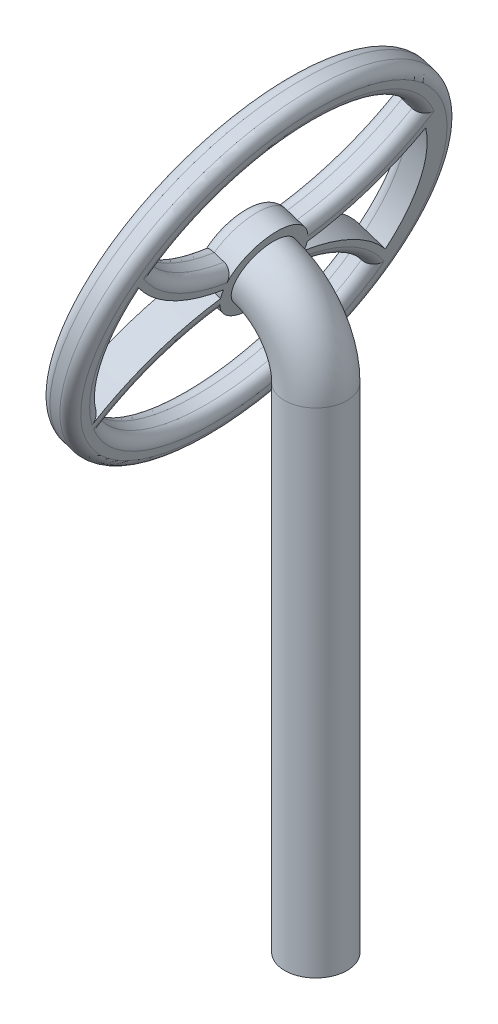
ISO-10303-21;
HEADER;
FILE_DESCRIPTION(('STEP AP214'),'2;1');
FILE_NAME('part.step','',(''),(''),'','','');
FILE_SCHEMA(('AUTOMOTIVE_DESIGN { 1 0 10303 214 1 1 1 1 }'));
ENDSEC;
DATA;
#1=APPLICATION_CONTEXT('core data for automotive mechanical design processes');
#2=APPLICATION_PROTOCOL_DEFINITION('international standard','automotive_design',2000,#1);
#3=PRODUCT_CONTEXT('',#1,'mechanical');
#4=PRODUCT('Part','Part','',(#3));
#5=PRODUCT_RELATED_PRODUCT_CATEGORY('part','',(#4));
#6=PRODUCT_DEFINITION_FORMATION('','',#4);
#7=PRODUCT_DEFINITION_CONTEXT('part definition',#1,'design');
#8=PRODUCT_DEFINITION('design','',#6,#7);
#9=PRODUCT_DEFINITION_SHAPE('','',#8);
#10=(LENGTH_UNIT() NAMED_UNIT(*) SI_UNIT(.MILLI.,.METRE.));
#11=(NAMED_UNIT(*) PLANE_ANGLE_UNIT() SI_UNIT($,.RADIAN.));
#12=(NAMED_UNIT(*) SI_UNIT($,.STERADIAN.) SOLID_ANGLE_UNIT());
#13=UNCERTAINTY_MEASURE_WITH_UNIT(LENGTH_MEASURE(1.E-05),#10,'distance_accuracy_value','');
#14=(GEOMETRIC_REPRESENTATION_CONTEXT(3) GLOBAL_UNCERTAINTY_ASSIGNED_CONTEXT((#13)) GLOBAL_UNIT_ASSIGNED_CONTEXT((#10,
#11,#12)) REPRESENTATION_CONTEXT('',''));
#15=CARTESIAN_POINT('',(0.,0.,0.));
#16=DIRECTION('',(0.,0.,1.));
#17=DIRECTION('',(1.,0.,0.));
#18=AXIS2_PLACEMENT_3D('',#15,#16,#17);
#19=CARTESIAN_POINT('',(-3.59945443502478,23.70185264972,0.));
#20=DIRECTION('',(0.,0.,1.));
#21=DIRECTION('',(1.,0.,0.));
#22=AXIS2_PLACEMENT_3D('',#19,#20,#21);
#23=TOROIDAL_SURFACE('',#22,3.59945443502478,1.5);
#24=CARTESIAN_POINT('',(0.,23.70185264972,0.));
#25=DIRECTION('',(0.,1.,0.));
#26=DIRECTION('',(0.,0.,1.));
#27=AXIS2_PLACEMENT_3D('',#24,#25,#26);
#28=CIRCLE('',#27,1.5);
#29=CARTESIAN_POINT('',(1.5,23.70185264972,0.));
#30=VERTEX_POINT('',#29);
#31=EDGE_CURVE('E317',#30,#30,#28,.T.);
#32=CARTESIAN_POINT('',(-2.49585563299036,27.1279498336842,0.));
#33=DIRECTION('',(-0.951837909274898,0.306601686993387,0.));
#34=DIRECTION('',(0.,0.,1.));
#35=AXIS2_PLACEMENT_3D('',#32,#33,#34);
#36=CIRCLE('',#35,1.5);
#37=CARTESIAN_POINT('',(-2.03595310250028,28.5557066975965,0.));
#38=VERTEX_POINT('',#37);
#39=EDGE_CURVE('E320',#38,#38,#36,.T.);
#40=CARTESIAN_POINT('',(-3.59945443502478,23.70185264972,0.));
#41=DIRECTION('',(0.,0.,1.));
#42=DIRECTION('',(1.,0.,0.));
#43=AXIS2_PLACEMENT_3D('',#40,#41,#42);
#44=CIRCLE('',#43,5.09945443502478);
#45=EDGE_CURVE('',#30,#38,#44,.T.);
#46=ORIENTED_EDGE('',*,*,#31,.T.);
#47=ORIENTED_EDGE('',*,*,#39,.F.);
#48=ORIENTED_EDGE('',*,*,#45,.T.);
#49=ORIENTED_EDGE('',*,*,#45,.F.);
#50=EDGE_LOOP('',(#46,#48,#47,#49));
#51=FACE_BOUND('',#50,.T.);
#52=ADVANCED_FACE('F30',(#51),#23,.T.);
#53=CARTESIAN_POINT('',(0.,23.70185264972,0.));
#54=DIRECTION('',(0.,-1.,0.));
#55=DIRECTION('',(0.,0.,-1.));
#56=AXIS2_PLACEMENT_3D('',#53,#54,#55);
#57=CYLINDRICAL_SURFACE('',#56,1.5);
#58=ORIENTED_EDGE('',*,*,#31,.F.);
#59=EDGE_LOOP('',(#58));
#60=FACE_BOUND('',#59,.T.);
#61=CARTESIAN_POINT('',(0.,0.,0.));
#62=DIRECTION('',(0.,1.,0.));
#63=DIRECTION('',(0.,0.,1.));
#64=AXIS2_PLACEMENT_3D('',#61,#62,#63);
#65=CIRCLE('',#64,1.5);
#66=CARTESIAN_POINT('',(0.,0.,1.5));
#67=VERTEX_POINT('',#66);
#68=EDGE_CURVE('E314',#67,#67,#65,.T.);
#69=ORIENTED_EDGE('',*,*,#68,.T.);
#70=EDGE_LOOP('',(#69));
#71=FACE_BOUND('',#70,.T.);
#72=ADVANCED_FACE('F505',(#60,#71),#57,.T.);
#73=CARTESIAN_POINT('',(0.,0.,0.));
#74=DIRECTION('',(0.,1.,0.));
#75=DIRECTION('',(0.,0.,1.));
#76=AXIS2_PLACEMENT_3D('',#73,#74,#75);
#77=PLANE('',#76);
#78=ORIENTED_EDGE('',*,*,#68,.F.);
#79=EDGE_LOOP('',(#78));
#80=FACE_BOUND('',#79,.T.);
#81=ADVANCED_FACE('F510',(#80),#77,.F.);
#82=CARTESIAN_POINT('',(-3.92361249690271,27.5878523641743,0.));
#83=DIRECTION('',(-0.951837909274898,0.306601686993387,0.));
#84=DIRECTION('',(-0.306601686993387,-0.951837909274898,0.));
#85=AXIS2_PLACEMENT_3D('',#82,#83,#84);
#86=PLANE('',#85);
#87=CARTESIAN_POINT('',(-6.65584270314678,19.1057063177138,0.));
#88=DIRECTION('',(-0.951837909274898,0.306601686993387,0.));
#89=DIRECTION('',(-0.306601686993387,-0.951837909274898,0.));
#90=AXIS2_PLACEMENT_3D('',#87,#88,#89);
#91=CIRCLE('',#90,8.58115420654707);
#92=CARTESIAN_POINT('',(-4.06269454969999,27.1560753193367,1.45029276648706));
#93=VERTEX_POINT('',#92);
#94=CARTESIAN_POINT('',(-5.12354512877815,23.8626890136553,6.97562809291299));
#95=VERTEX_POINT('',#94);
#96=EDGE_CURVE('E351',#93,#95,#91,.F.);
#97=ORIENTED_EDGE('',*,*,#96,.T.);
#98=CARTESIAN_POINT('',(-3.92361249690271,27.5878523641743,0.));
#99=DIRECTION('',(-0.951837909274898,0.306601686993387,0.));
#100=DIRECTION('',(-0.306601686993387,-0.951837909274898,0.));
#101=AXIS2_PLACEMENT_3D('',#98,#99,#100);
#102=CIRCLE('',#101,7.99850408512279);
#103=CARTESIAN_POINT('',(-5.12354512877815,23.8626890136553,-6.97562809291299));
#104=VERTEX_POINT('',#103);
#105=EDGE_CURVE('E353',#95,#104,#102,.F.);
#106=ORIENTED_EDGE('',*,*,#105,.T.);
#107=CARTESIAN_POINT('',(-6.65584270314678,19.1057063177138,0.));
#108=DIRECTION('',(-0.951837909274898,0.306601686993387,0.));
#109=DIRECTION('',(-0.306601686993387,-0.951837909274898,0.));
#110=AXIS2_PLACEMENT_3D('',#107,#108,#109);
#111=CIRCLE('',#110,8.58115420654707);
#112=CARTESIAN_POINT('',(-4.06269454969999,27.1560753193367,-1.45029276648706));
#113=VERTEX_POINT('',#112);
#114=EDGE_CURVE('E347',#104,#113,#111,.F.);
#115=ORIENTED_EDGE('',*,*,#114,.T.);
#116=CARTESIAN_POINT('',(-3.92361249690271,27.5878523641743,0.));
#117=DIRECTION('',(-0.951837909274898,0.306601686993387,0.));
#118=DIRECTION('',(-0.306601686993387,-0.951837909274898,0.));
#119=AXIS2_PLACEMENT_3D('',#116,#117,#118);
#120=CIRCLE('',#119,1.51958031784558);
#121=EDGE_CURVE('E349',#113,#93,#120,.T.);
#122=ORIENTED_EDGE('',*,*,#121,.T.);
#123=EDGE_LOOP('',(#97,#106,#115,#122));
#124=FACE_BOUND('',#123,.T.);
#125=CARTESIAN_POINT('',(-3.92361249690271,27.5878523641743,0.));
#126=DIRECTION('',(-0.951837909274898,0.306601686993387,0.));
#127=DIRECTION('',(-0.306601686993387,-0.951837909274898,0.));
#128=AXIS2_PLACEMENT_3D('',#125,#126,#127);
#129=CIRCLE('',#128,1.51958031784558);
#130=CARTESIAN_POINT('',(-3.78453044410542,28.0196294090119,1.45029276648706));
#131=VERTEX_POINT('',#130);
#132=CARTESIAN_POINT('',(-3.78453044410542,28.0196294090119,-1.45029276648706));
#133=VERTEX_POINT('',#132);
#134=EDGE_CURVE('E342',#131,#133,#129,.T.);
#135=ORIENTED_EDGE('',*,*,#134,.T.);
#136=CARTESIAN_POINT('',(-1.19138229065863,36.0699984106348,0.));
#137=DIRECTION('',(-0.951837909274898,0.306601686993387,0.));
#138=DIRECTION('',(-0.306601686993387,-0.951837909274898,0.));
#139=AXIS2_PLACEMENT_3D('',#136,#137,#138);
#140=CIRCLE('',#139,8.58115420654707);
#141=CARTESIAN_POINT('',(-2.72367986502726,31.3130157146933,-6.97562809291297));
#142=VERTEX_POINT('',#141);
#143=EDGE_CURVE('E344',#133,#142,#140,.F.);
#144=ORIENTED_EDGE('',*,*,#143,.T.);
#145=CARTESIAN_POINT('',(-3.92361249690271,27.5878523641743,0.));
#146=DIRECTION('',(-0.951837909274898,0.306601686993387,0.));
#147=DIRECTION('',(-0.306601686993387,-0.951837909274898,0.));
#148=AXIS2_PLACEMENT_3D('',#145,#146,#147);
#149=CIRCLE('',#148,7.99850408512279);
#150=CARTESIAN_POINT('',(-2.72367986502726,31.3130157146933,6.97562809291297));
#151=VERTEX_POINT('',#150);
#152=EDGE_CURVE('E338',#142,#151,#149,.F.);
#153=ORIENTED_EDGE('',*,*,#152,.T.);
#154=CARTESIAN_POINT('',(-1.19138229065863,36.0699984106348,0.));
#155=DIRECTION('',(-0.951837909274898,0.306601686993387,0.));
#156=DIRECTION('',(-0.306601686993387,-0.951837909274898,0.));
#157=AXIS2_PLACEMENT_3D('',#154,#155,#156);
#158=CIRCLE('',#157,8.58115420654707);
#159=EDGE_CURVE('E340',#151,#131,#158,.F.);
#160=ORIENTED_EDGE('',*,*,#159,.T.);
#161=EDGE_LOOP('',(#135,#144,#153,#160));
#162=FACE_BOUND('',#161,.T.);
#163=CARTESIAN_POINT('',(-3.92361249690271,27.5878523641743,0.));
#164=DIRECTION('',(-0.951837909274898,0.306601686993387,0.));
#165=DIRECTION('',(-0.306601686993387,-0.951837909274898,0.));
#166=AXIS2_PLACEMENT_3D('',#163,#164,#165);
#167=CIRCLE('',#166,8.41133454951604);
#168=CARTESIAN_POINT('',(-6.50254185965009,19.5816252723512,0.));
#169=VERTEX_POINT('',#168);
#170=EDGE_CURVE('E323',#169,#169,#167,.T.);
#171=ORIENTED_EDGE('',*,*,#170,.T.);
#172=EDGE_LOOP('',(#171));
#173=FACE_BOUND('',#172,.T.);
#174=CARTESIAN_POINT('',(-1.19138229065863,36.0699984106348,0.));
#175=DIRECTION('',(0.951837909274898,-0.306601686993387,0.));
#176=DIRECTION('',(-0.306601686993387,-0.951837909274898,0.));
#177=AXIS2_PLACEMENT_3D('',#174,#175,#176);
#178=CIRCLE('',#177,8.91133454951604);
#179=CARTESIAN_POINT('',(-2.82303827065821,31.0045598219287,7.14779085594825));
#180=VERTEX_POINT('',#179);
#181=CARTESIAN_POINT('',(-3.85344692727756,27.8056797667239,2.00657236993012));
#182=VERTEX_POINT('',#181);
#183=EDGE_CURVE('E285',#180,#182,#178,.T.);
#184=ORIENTED_EDGE('',*,*,#183,.F.);
#185=CARTESIAN_POINT('',(-3.92361249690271,27.5878523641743,0.));
#186=DIRECTION('',(-0.951837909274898,0.306601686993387,0.));
#187=DIRECTION('',(-0.306601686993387,-0.951837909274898,0.));
#188=AXIS2_PLACEMENT_3D('',#185,#186,#187);
#189=CIRCLE('',#188,7.99850408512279);
#190=CARTESIAN_POINT('',(-5.0241867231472,24.1711449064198,7.14779085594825));
#191=VERTEX_POINT('',#190);
#192=EDGE_CURVE('E402',#180,#191,#189,.F.);
#193=ORIENTED_EDGE('',*,*,#192,.T.);
#194=CARTESIAN_POINT('',(-6.65584270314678,19.1057063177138,0.));
#195=DIRECTION('',(0.951837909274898,-0.306601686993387,0.));
#196=DIRECTION('',(0.306601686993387,0.951837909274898,0.));
#197=AXIS2_PLACEMENT_3D('',#194,#195,#196);
#198=CIRCLE('',#197,8.91133454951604);
#199=CARTESIAN_POINT('',(-3.99377806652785,27.3700249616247,2.00657236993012));
#200=VERTEX_POINT('',#199);
#201=EDGE_CURVE('E289',#200,#191,#198,.T.);
#202=ORIENTED_EDGE('',*,*,#201,.F.);
#203=CARTESIAN_POINT('',(-3.92361249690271,27.5878523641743,0.));
#204=DIRECTION('',(0.951837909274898,-0.306601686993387,0.));
#205=DIRECTION('',(-0.306601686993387,-0.951837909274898,0.));
#206=AXIS2_PLACEMENT_3D('',#203,#204,#205);
#207=CIRCLE('',#206,2.01958031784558);
#208=EDGE_CURVE('E287',#182,#200,#207,.T.);
#209=ORIENTED_EDGE('',*,*,#208,.F.);
#210=EDGE_LOOP('',(#184,#193,#202,#209));
#211=FACE_BOUND('',#210,.T.);
#212=CARTESIAN_POINT('',(-6.65584270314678,19.1057063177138,0.));
#213=DIRECTION('',(0.951837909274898,-0.306601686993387,0.));
#214=DIRECTION('',(0.306601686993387,0.951837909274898,0.));
#215=AXIS2_PLACEMENT_3D('',#212,#213,#214);
#216=CIRCLE('',#215,8.91133454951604);
#217=CARTESIAN_POINT('',(-5.0241867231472,24.1711449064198,-7.14779085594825));
#218=VERTEX_POINT('',#217);
#219=CARTESIAN_POINT('',(-3.99377806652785,27.3700249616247,-2.00657236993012));
#220=VERTEX_POINT('',#219);
#221=EDGE_CURVE('E252',#218,#220,#216,.T.);
#222=ORIENTED_EDGE('',*,*,#221,.F.);
#223=CARTESIAN_POINT('',(-3.92361249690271,27.5878523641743,0.));
#224=DIRECTION('',(-0.951837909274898,0.306601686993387,0.));
#225=DIRECTION('',(-0.306601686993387,-0.951837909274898,0.));
#226=AXIS2_PLACEMENT_3D('',#223,#224,#225);
#227=CIRCLE('',#226,7.99850408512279);
#228=CARTESIAN_POINT('',(-2.82303827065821,31.0045598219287,-7.14779085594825));
#229=VERTEX_POINT('',#228);
#230=EDGE_CURVE('E399',#218,#229,#227,.F.);
#231=ORIENTED_EDGE('',*,*,#230,.T.);
#232=CARTESIAN_POINT('',(-1.19138229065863,36.0699984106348,0.));
#233=DIRECTION('',(0.951837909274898,-0.306601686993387,0.));
#234=DIRECTION('',(-0.306601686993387,-0.951837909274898,0.));
#235=AXIS2_PLACEMENT_3D('',#232,#233,#234);
#236=CIRCLE('',#235,8.91133454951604);
#237=CARTESIAN_POINT('',(-3.85344692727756,27.8056797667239,-2.00657236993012));
#238=VERTEX_POINT('',#237);
#239=EDGE_CURVE('E257',#238,#229,#236,.T.);
#240=ORIENTED_EDGE('',*,*,#239,.F.);
#241=CARTESIAN_POINT('',(-3.92361249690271,27.5878523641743,0.));
#242=DIRECTION('',(0.951837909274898,-0.306601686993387,0.));
#243=DIRECTION('',(-0.306601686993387,-0.951837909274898,0.));
#244=AXIS2_PLACEMENT_3D('',#241,#242,#243);
#245=CIRCLE('',#244,2.01958031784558);
#246=EDGE_CURVE('E254',#220,#238,#245,.T.);
#247=ORIENTED_EDGE('',*,*,#246,.F.);
#248=EDGE_LOOP('',(#222,#231,#240,#247));
#249=FACE_BOUND('',#248,.T.);
#250=ADVANCED_FACE('F519',(#124,#162,#173,#211,#249),#86,.T.);
#251=CARTESIAN_POINT('',(-2.49585563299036,27.1279498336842,0.));
#252=DIRECTION('',(-0.951837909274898,0.306601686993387,0.));
#253=DIRECTION('',(-0.306601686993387,-0.951837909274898,0.));
#254=AXIS2_PLACEMENT_3D('',#251,#252,#253);
#255=PLANE('',#254);
#256=CARTESIAN_POINT('',(-2.49585563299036,27.1279498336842,0.));
#257=DIRECTION('',(-0.951837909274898,0.306601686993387,0.));
#258=DIRECTION('',(-0.306601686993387,-0.951837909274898,0.));
#259=AXIS2_PLACEMENT_3D('',#256,#257,#258);
#260=CIRCLE('',#259,8.41133454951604);
#261=CARTESIAN_POINT('',(-5.07478499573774,19.1217227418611,0.));
#262=VERTEX_POINT('',#261);
#263=EDGE_CURVE('E332',#262,#262,#260,.F.);
#264=ORIENTED_EDGE('',*,*,#263,.T.);
#265=EDGE_LOOP('',(#264));
#266=FACE_BOUND('',#265,.T.);
#267=ORIENTED_EDGE('',*,*,#39,.T.);
#268=EDGE_LOOP('',(#267));
#269=FACE_BOUND('',#268,.T.);
#270=CARTESIAN_POINT('',(-5.22808583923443,18.6458037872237,0.));
#271=DIRECTION('',(-0.951837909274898,0.306601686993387,0.));
#272=DIRECTION('',(-0.306601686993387,-0.951837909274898,0.));
#273=AXIS2_PLACEMENT_3D('',#270,#271,#272);
#274=CIRCLE('',#273,8.58115420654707);
#275=CARTESIAN_POINT('',(-2.66537960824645,26.6016665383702,-1.94241915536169));
#276=VERTEX_POINT('',#275);
#277=CARTESIAN_POINT('',(-3.6957882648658,23.4027864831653,-6.97562809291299));
#278=VERTEX_POINT('',#277);
#279=EDGE_CURVE('E481',#276,#278,#274,.T.);
#280=ORIENTED_EDGE('',*,*,#279,.T.);
#281=CARTESIAN_POINT('',(-2.49585563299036,27.1279498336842,0.));
#282=DIRECTION('',(-0.951837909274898,0.306601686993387,0.));
#283=DIRECTION('',(-0.306601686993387,-0.951837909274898,0.));
#284=AXIS2_PLACEMENT_3D('',#281,#282,#283);
#285=CIRCLE('',#284,7.99850408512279);
#286=CARTESIAN_POINT('',(-3.6957882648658,23.4027864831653,6.97562809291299));
#287=VERTEX_POINT('',#286);
#288=EDGE_CURVE('E382',#278,#287,#285,.T.);
#289=ORIENTED_EDGE('',*,*,#288,.T.);
#290=CARTESIAN_POINT('',(-5.22808583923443,18.6458037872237,0.));
#291=DIRECTION('',(-0.951837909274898,0.306601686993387,0.));
#292=DIRECTION('',(-0.306601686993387,-0.951837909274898,0.));
#293=AXIS2_PLACEMENT_3D('',#290,#291,#292);
#294=CIRCLE('',#293,8.58115420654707);
#295=CARTESIAN_POINT('',(-2.66537960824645,26.6016665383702,1.94241915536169));
#296=VERTEX_POINT('',#295);
#297=EDGE_CURVE('E379',#287,#296,#294,.T.);
#298=ORIENTED_EDGE('',*,*,#297,.T.);
#299=CARTESIAN_POINT('',(-2.49585563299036,27.1279498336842,0.));
#300=DIRECTION('',(0.951837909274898,-0.306601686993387,0.));
#301=DIRECTION('',(-0.306601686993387,-0.951837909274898,0.));
#302=AXIS2_PLACEMENT_3D('',#299,#300,#301);
#303=CIRCLE('',#302,2.01958031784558);
#304=EDGE_CURVE('E223',#296,#276,#303,.T.);
#305=ORIENTED_EDGE('',*,*,#304,.T.);
#306=EDGE_LOOP('',(#280,#289,#298,#305));
#307=FACE_BOUND('',#306,.T.);
#308=CARTESIAN_POINT('',(0.236374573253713,35.6100958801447,0.));
#309=DIRECTION('',(-0.951837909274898,0.306601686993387,0.));
#310=DIRECTION('',(-0.306601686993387,-0.951837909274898,0.));
#311=AXIS2_PLACEMENT_3D('',#308,#309,#310);
#312=CIRCLE('',#311,8.58115420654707);
#313=CARTESIAN_POINT('',(-1.29592300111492,30.8531131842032,-6.97562809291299));
#314=VERTEX_POINT('',#313);
#315=CARTESIAN_POINT('',(-2.32633165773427,27.6542331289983,-1.94241915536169));
#316=VERTEX_POINT('',#315);
#317=EDGE_CURVE('E443',#314,#316,#312,.T.);
#318=ORIENTED_EDGE('',*,*,#317,.T.);
#319=CARTESIAN_POINT('',(-2.49585563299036,27.1279498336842,0.));
#320=DIRECTION('',(0.951837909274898,-0.306601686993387,0.));
#321=DIRECTION('',(-0.306601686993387,-0.951837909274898,0.));
#322=AXIS2_PLACEMENT_3D('',#319,#320,#321);
#323=CIRCLE('',#322,2.01958031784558);
#324=CARTESIAN_POINT('',(-2.32633165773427,27.6542331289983,1.94241915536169));
#325=VERTEX_POINT('',#324);
#326=EDGE_CURVE('E53',#316,#325,#323,.T.);
#327=ORIENTED_EDGE('',*,*,#326,.T.);
#328=CARTESIAN_POINT('',(0.236374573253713,35.6100958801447,0.));
#329=DIRECTION('',(-0.951837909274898,0.306601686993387,0.));
#330=DIRECTION('',(-0.306601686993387,-0.951837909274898,0.));
#331=AXIS2_PLACEMENT_3D('',#328,#329,#330);
#332=CIRCLE('',#331,8.58115420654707);
#333=CARTESIAN_POINT('',(-1.29592300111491,30.8531131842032,6.97562809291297));
#334=VERTEX_POINT('',#333);
#335=EDGE_CURVE('E376',#325,#334,#332,.T.);
#336=ORIENTED_EDGE('',*,*,#335,.T.);
#337=CARTESIAN_POINT('',(-2.49585563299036,27.1279498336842,0.));
#338=DIRECTION('',(-0.951837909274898,0.306601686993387,0.));
#339=DIRECTION('',(-0.306601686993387,-0.951837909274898,0.));
#340=AXIS2_PLACEMENT_3D('',#337,#338,#339);
#341=CIRCLE('',#340,7.99850408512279);
#342=EDGE_CURVE('E374',#334,#314,#341,.T.);
#343=ORIENTED_EDGE('',*,*,#342,.T.);
#344=EDGE_LOOP('',(#318,#327,#336,#343));
#345=FACE_BOUND('',#344,.T.);
#346=CARTESIAN_POINT('',(-2.49585563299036,27.1279498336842,0.));
#347=DIRECTION('',(-0.951837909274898,0.306601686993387,0.));
#348=DIRECTION('',(-0.306601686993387,-0.951837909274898,0.));
#349=AXIS2_PLACEMENT_3D('',#346,#347,#348);
#350=CIRCLE('',#349,7.99850408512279);
#351=CARTESIAN_POINT('',(-3.59642985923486,23.7112423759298,7.14779085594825));
#352=VERTEX_POINT('',#351);
#353=CARTESIAN_POINT('',(-1.39528140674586,30.5446572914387,7.14779085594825));
#354=VERTEX_POINT('',#353);
#355=EDGE_CURVE('E371',#352,#354,#350,.T.);
#356=ORIENTED_EDGE('',*,*,#355,.T.);
#357=CARTESIAN_POINT('',(0.236374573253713,35.6100958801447,0.));
#358=DIRECTION('',(0.951837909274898,-0.306601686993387,0.));
#359=DIRECTION('',(-0.306601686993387,-0.951837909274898,0.));
#360=AXIS2_PLACEMENT_3D('',#357,#358,#359);
#361=CIRCLE('',#360,8.91133454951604);
#362=CARTESIAN_POINT('',(-2.42569006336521,27.3457772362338,2.00657236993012));
#363=VERTEX_POINT('',#362);
#364=EDGE_CURVE('E277',#354,#363,#361,.T.);
#365=ORIENTED_EDGE('',*,*,#364,.T.);
#366=CARTESIAN_POINT('',(-2.49585563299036,27.1279498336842,0.));
#367=DIRECTION('',(0.951837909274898,-0.306601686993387,0.));
#368=DIRECTION('',(-0.306601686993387,-0.951837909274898,0.));
#369=AXIS2_PLACEMENT_3D('',#366,#367,#368);
#370=CIRCLE('',#369,2.01958031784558);
#371=CARTESIAN_POINT('',(-2.56602120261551,26.9101224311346,2.00657236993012));
#372=VERTEX_POINT('',#371);
#373=EDGE_CURVE('E280',#363,#372,#370,.T.);
#374=ORIENTED_EDGE('',*,*,#373,.T.);
#375=CARTESIAN_POINT('',(-5.22808583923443,18.6458037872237,0.));
#376=DIRECTION('',(0.951837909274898,-0.306601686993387,0.));
#377=DIRECTION('',(0.306601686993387,0.951837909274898,0.));
#378=AXIS2_PLACEMENT_3D('',#375,#376,#377);
#379=CIRCLE('',#378,8.91133454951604);
#380=EDGE_CURVE('E283',#372,#352,#379,.T.);
#381=ORIENTED_EDGE('',*,*,#380,.T.);
#382=EDGE_LOOP('',(#356,#365,#374,#381));
#383=FACE_BOUND('',#382,.T.);
#384=CARTESIAN_POINT('',(-2.49585563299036,27.1279498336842,0.));
#385=DIRECTION('',(-0.951837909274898,0.306601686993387,0.));
#386=DIRECTION('',(-0.306601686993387,-0.951837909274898,0.));
#387=AXIS2_PLACEMENT_3D('',#384,#385,#386);
#388=CIRCLE('',#387,7.49850408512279);
#389=CARTESIAN_POINT('',(-1.52857818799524,30.1308404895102,-6.80254258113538));
#390=VERTEX_POINT('',#389);
#391=CARTESIAN_POINT('',(-3.46313307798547,24.1250591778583,-6.80254258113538));
#392=VERTEX_POINT('',#391);
#393=EDGE_CURVE('E217',#390,#392,#388,.T.);
#394=ORIENTED_EDGE('',*,*,#393,.T.);
#395=CARTESIAN_POINT('',(-5.22808583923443,18.6458037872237,0.));
#396=DIRECTION('',(0.951837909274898,-0.306601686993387,0.));
#397=DIRECTION('',(0.306601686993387,0.951837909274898,0.));
#398=AXIS2_PLACEMENT_3D('',#395,#396,#397);
#399=CIRCLE('',#398,8.91133454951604);
#400=CARTESIAN_POINT('',(-2.56602120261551,26.9101224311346,-2.00657236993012));
#401=VERTEX_POINT('',#400);
#402=EDGE_CURVE('E227',#392,#401,#399,.T.);
#403=ORIENTED_EDGE('',*,*,#402,.T.);
#404=CARTESIAN_POINT('',(-2.49585563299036,27.1279498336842,0.));
#405=DIRECTION('',(0.951837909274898,-0.306601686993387,0.));
#406=DIRECTION('',(-0.306601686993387,-0.951837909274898,0.));
#407=AXIS2_PLACEMENT_3D('',#404,#405,#406);
#408=CIRCLE('',#407,2.01958031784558);
#409=CARTESIAN_POINT('',(-2.42569006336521,27.3457772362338,-2.00657236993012));
#410=VERTEX_POINT('',#409);
#411=EDGE_CURVE('E233',#401,#410,#408,.T.);
#412=ORIENTED_EDGE('',*,*,#411,.T.);
#413=CARTESIAN_POINT('',(0.236374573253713,35.6100958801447,0.));
#414=DIRECTION('',(0.951837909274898,-0.306601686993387,0.));
#415=DIRECTION('',(-0.306601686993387,-0.951837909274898,0.));
#416=AXIS2_PLACEMENT_3D('',#413,#414,#415);
#417=CIRCLE('',#416,8.91133454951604);
#418=EDGE_CURVE('E237',#410,#390,#417,.T.);
#419=ORIENTED_EDGE('',*,*,#418,.T.);
#420=EDGE_LOOP('',(#394,#403,#412,#419));
#421=FACE_BOUND('',#420,.T.);
#422=ADVANCED_FACE('F235',(#266,#269,#307,#345,#383,#421),#255,.F.);
#423=CARTESIAN_POINT('',(-3.92361249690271,27.5878523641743,0.));
#424=DIRECTION('',(0.951837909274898,-0.306601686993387,0.));
#425=DIRECTION('',(0.306601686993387,0.951837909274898,0.));
#426=AXIS2_PLACEMENT_3D('',#423,#424,#425);
#427=CYLINDRICAL_SURFACE('',#426,8.91133454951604);
#428=CARTESIAN_POINT('',(-3.44769354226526,27.4345515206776,0.));
#429=DIRECTION('',(-0.951837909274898,0.306601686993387,0.));
#430=DIRECTION('',(-0.306601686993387,-0.951837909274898,0.));
#431=AXIS2_PLACEMENT_3D('',#428,#429,#430);
#432=CIRCLE('',#431,8.91133454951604);
#433=CARTESIAN_POINT('',(-6.17992374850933,18.9524054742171,0.));
#434=VERTEX_POINT('',#433);
#435=EDGE_CURVE('E329',#434,#434,#432,.F.);
#436=ORIENTED_EDGE('',*,*,#435,.T.);
#437=EDGE_LOOP('',(#436));
#438=FACE_BOUND('',#437,.T.);
#439=CARTESIAN_POINT('',(-2.97177458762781,27.2812506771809,0.));
#440=DIRECTION('',(-0.951837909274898,0.306601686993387,0.));
#441=DIRECTION('',(-0.306601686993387,-0.951837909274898,0.));
#442=AXIS2_PLACEMENT_3D('',#439,#440,#441);
#443=CIRCLE('',#442,8.91133454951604);
#444=CARTESIAN_POINT('',(-5.70400479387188,18.7991046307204,0.));
#445=VERTEX_POINT('',#444);
#446=EDGE_CURVE('E326',#445,#445,#443,.T.);
#447=ORIENTED_EDGE('',*,*,#446,.T.);
#448=EDGE_LOOP('',(#447));
#449=FACE_BOUND('',#448,.T.);
#450=ADVANCED_FACE('F518',(#438,#449),#427,.T.);
#451=CARTESIAN_POINT('',(-3.92361249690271,27.5878523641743,0.));
#452=DIRECTION('',(0.951837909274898,-0.306601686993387,0.));
#453=DIRECTION('',(0.306601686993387,0.951837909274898,0.));
#454=AXIS2_PLACEMENT_3D('',#451,#452,#453);
#455=CYLINDRICAL_SURFACE('',#454,7.49850408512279);
#456=DIRECTION('',(0.951837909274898,-0.306601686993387,0.));
#457=VECTOR('',#456,1.);
#458=CARTESIAN_POINT('',(-2.71365659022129,31.3441327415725,-6.37604328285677));
#459=LINE('',#458,#457);
#460=CARTESIAN_POINT('',(-2.23773763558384,31.1908318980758,-6.37604328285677));
#461=VERTEX_POINT('',#460);
#462=CARTESIAN_POINT('',(-1.76181868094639,31.0375310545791,-6.37604328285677));
#463=VERTEX_POINT('',#462);
#464=EDGE_CURVE('E311',#461,#463,#459,.T.);
#465=ORIENTED_EDGE('',*,*,#464,.T.);
#466=CARTESIAN_POINT('',(-2.97177458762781,27.2812506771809,0.));
#467=DIRECTION('',(-0.951837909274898,0.306601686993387,0.));
#468=DIRECTION('',(-0.306601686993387,-0.951837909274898,0.));
#469=AXIS2_PLACEMENT_3D('',#466,#467,#468);
#470=CIRCLE('',#469,7.49850408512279);
#471=CARTESIAN_POINT('',(-1.76181868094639,31.0375310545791,6.37604328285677));
#472=VERTEX_POINT('',#471);
#473=EDGE_CURVE('E392',#463,#472,#470,.F.);
#474=ORIENTED_EDGE('',*,*,#473,.T.);
#475=DIRECTION('',(0.951837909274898,-0.306601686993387,0.));
#476=VECTOR('',#475,1.);
#477=CARTESIAN_POINT('',(-2.71365659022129,31.3441327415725,6.37604328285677));
#478=LINE('',#477,#476);
#479=CARTESIAN_POINT('',(-2.23773763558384,31.1908318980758,6.37604328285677));
#480=VERTEX_POINT('',#479);
#481=EDGE_CURVE('E303',#480,#472,#478,.T.);
#482=ORIENTED_EDGE('',*,*,#481,.F.);
#483=CARTESIAN_POINT('',(-3.44769354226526,27.4345515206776,0.));
#484=DIRECTION('',(-0.951837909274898,0.306601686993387,0.));
#485=DIRECTION('',(-0.306601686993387,-0.951837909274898,0.));
#486=AXIS2_PLACEMENT_3D('',#483,#484,#485);
#487=CIRCLE('',#486,7.49850408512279);
#488=EDGE_CURVE('E369',#480,#461,#487,.T.);
#489=ORIENTED_EDGE('',*,*,#488,.T.);
#490=EDGE_LOOP('',(#465,#474,#482,#489));
#491=FACE_BOUND('',#490,.T.);
#492=ADVANCED_FACE('F729',(#491),#455,.F.);
#493=CARTESIAN_POINT('',(-1.19138229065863,36.0699984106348,0.));
#494=DIRECTION('',(0.951837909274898,-0.306601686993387,0.));
#495=DIRECTION('',(0.306601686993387,0.951837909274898,0.));
#496=AXIS2_PLACEMENT_3D('',#493,#494,#495);
#497=CYLINDRICAL_SURFACE('',#496,8.08115420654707);
#498=DIRECTION('',(0.951837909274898,-0.306601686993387,0.));
#499=VECTOR('',#498,1.);
#500=CARTESIAN_POINT('',(-3.61076846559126,28.5590694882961,-1.74286275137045));
#501=LINE('',#500,#499);
#502=CARTESIAN_POINT('',(-3.13484951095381,28.4057686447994,-1.74286275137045));
#503=VERTEX_POINT('',#502);
#504=CARTESIAN_POINT('',(-2.65893055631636,28.2524678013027,-1.74286275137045));
#505=VERTEX_POINT('',#504);
#506=EDGE_CURVE('E309',#503,#505,#501,.T.);
#507=ORIENTED_EDGE('',*,*,#506,.T.);
#508=CARTESIAN_POINT('',(-0.239544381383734,35.7633967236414,0.));
#509=DIRECTION('',(-0.951837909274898,0.306601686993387,0.));
#510=DIRECTION('',(-0.306601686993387,-0.951837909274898,0.));
#511=AXIS2_PLACEMENT_3D('',#508,#509,#510);
#512=CIRCLE('',#511,8.08115420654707);
#513=EDGE_CURVE('E771',#505,#463,#512,.F.);
#514=ORIENTED_EDGE('',*,*,#513,.T.);
#515=ORIENTED_EDGE('',*,*,#464,.F.);
#516=CARTESIAN_POINT('',(-0.715463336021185,35.9166975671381,0.));
#517=DIRECTION('',(-0.951837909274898,0.306601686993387,0.));
#518=DIRECTION('',(-0.306601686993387,-0.951837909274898,0.));
#519=AXIS2_PLACEMENT_3D('',#516,#517,#518);
#520=CIRCLE('',#519,8.08115420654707);
#521=EDGE_CURVE('E362',#461,#503,#520,.T.);
#522=ORIENTED_EDGE('',*,*,#521,.T.);
#523=EDGE_LOOP('',(#507,#514,#515,#522));
#524=FACE_BOUND('',#523,.T.);
#525=ADVANCED_FACE('F734',(#524),#497,.F.);
#526=CARTESIAN_POINT('',(-3.92361249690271,27.5878523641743,0.));
#527=DIRECTION('',(0.951837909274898,-0.306601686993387,0.));
#528=DIRECTION('',(0.306601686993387,0.951837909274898,0.));
#529=AXIS2_PLACEMENT_3D('',#526,#527,#528);
#530=CYLINDRICAL_SURFACE('',#529,2.01958031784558);
#531=ORIENTED_EDGE('',*,*,#506,.F.);
#532=CARTESIAN_POINT('',(-3.44769354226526,27.4345515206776,0.));
#533=DIRECTION('',(-0.951837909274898,0.306601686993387,0.));
#534=DIRECTION('',(-0.306601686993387,-0.951837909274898,0.));
#535=AXIS2_PLACEMENT_3D('',#532,#533,#534);
#536=CIRCLE('',#535,2.01958031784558);
#537=CARTESIAN_POINT('',(-3.13484951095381,28.4057686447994,1.74286275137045));
#538=VERTEX_POINT('',#537);
#539=EDGE_CURVE('E365',#503,#538,#536,.F.);
#540=ORIENTED_EDGE('',*,*,#539,.T.);
#541=DIRECTION('',(0.951837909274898,-0.306601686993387,0.));
#542=VECTOR('',#541,1.);
#543=CARTESIAN_POINT('',(-3.61076846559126,28.5590694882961,1.74286275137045));
#544=LINE('',#543,#542);
#545=CARTESIAN_POINT('',(-2.65893055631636,28.2524678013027,1.74286275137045));
#546=VERTEX_POINT('',#545);
#547=EDGE_CURVE('E306',#538,#546,#544,.T.);
#548=ORIENTED_EDGE('',*,*,#547,.T.);
#549=CARTESIAN_POINT('',(-2.65893055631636,28.2524678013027,1.74286275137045));
#550=CARTESIAN_POINT('',(-2.63285548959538,28.2440908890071,1.74283193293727));
#551=CARTESIAN_POINT('',(-2.60743925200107,28.2337396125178,1.7440563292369));
#552=CARTESIAN_POINT('',(-2.55865936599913,28.2095060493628,1.74877618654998));
#553=CARTESIAN_POINT('',(-2.53529038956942,28.1956333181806,1.75226554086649));
#554=CARTESIAN_POINT('',(-2.49120013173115,28.1647305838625,1.76127679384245));
#555=CARTESIAN_POINT('',(-2.47047796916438,28.1477016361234,1.76679801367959));
#556=CARTESIAN_POINT('',(-2.43217777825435,28.1109257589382,1.77948167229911));
#557=CARTESIAN_POINT('',(-2.41460127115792,28.0911775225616,1.78664490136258));
#558=CARTESIAN_POINT('',(-2.38255685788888,28.0488159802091,1.80239417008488));
#559=CARTESIAN_POINT('',(-2.36819474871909,28.0261358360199,1.8110156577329));
#560=CARTESIAN_POINT('',(-2.34361378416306,27.9789008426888,1.82901465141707));
#561=CARTESIAN_POINT('',(-2.33339597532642,27.9543455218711,1.83839234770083));
#562=CARTESIAN_POINT('',(-2.31717040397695,27.9031987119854,1.85766595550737));
#563=CARTESIAN_POINT('',(-2.31129067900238,27.8765691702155,1.86756901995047));
#564=CARTESIAN_POINT('',(-2.30446024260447,27.822600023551,1.88710967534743));
#565=CARTESIAN_POINT('',(-2.30350556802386,27.7952610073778,1.89674747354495));
#566=CARTESIAN_POINT('',(-2.30614940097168,27.748784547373,1.9125281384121));
#567=CARTESIAN_POINT('',(-2.30847645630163,27.7296295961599,1.91885696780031));
#568=CARTESIAN_POINT('',(-2.31557684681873,27.6916320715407,1.93103026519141));
#569=CARTESIAN_POINT('',(-2.32034908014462,27.6727893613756,1.93687494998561));
#570=CARTESIAN_POINT('',(-2.32633165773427,27.6542331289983,1.94241915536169));
#571=B_SPLINE_CURVE_WITH_KNOTS('',3,(#549,#550,#551,#552,#553,#554,#555,#556,#557,#558,#559,
#560,#561,#562,#563,#564,#565,#566,#567,#568,#569,#570),.UNSPECIFIED.,.F.,.F.,(4,2,2,2,2,2,2,2,
2,2,4),(0.,0.0820244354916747,0.163828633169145,0.245605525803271,0.327421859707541,
0.411628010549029,0.495855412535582,0.582478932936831,0.669032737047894,0.729806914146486,
0.790553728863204),.UNSPECIFIED.);
#572=EDGE_CURVE('E413',#546,#325,#571,.T.);
#573=ORIENTED_EDGE('',*,*,#572,.T.);
#574=ORIENTED_EDGE('',*,*,#326,.F.);
#575=CARTESIAN_POINT('',(-2.32633165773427,27.6542331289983,-1.94241915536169));
#576=CARTESIAN_POINT('',(-2.31805889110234,27.6798345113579,-1.93478289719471));
#577=CARTESIAN_POINT('',(-2.3121185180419,27.7059867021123,-1.92655316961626));
#578=CARTESIAN_POINT('',(-2.30491496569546,27.7586048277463,-1.90929015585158));
#579=CARTESIAN_POINT('',(-2.30364136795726,27.7850699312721,-1.90025870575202));
#580=CARTESIAN_POINT('',(-2.30574652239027,27.8376400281,-1.88174067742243));
#581=CARTESIAN_POINT('',(-2.30912405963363,27.8637451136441,-1.87225421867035));
#582=CARTESIAN_POINT('',(-2.32036613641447,27.9149738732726,-1.85327258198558));
#583=CARTESIAN_POINT('',(-2.32823239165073,27.9400971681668,-1.84377740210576));
#584=CARTESIAN_POINT('',(-2.34844526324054,27.9893555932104,-1.82504663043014));
#585=CARTESIAN_POINT('',(-2.36089272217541,28.0134536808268,-1.81582236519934));
#586=CARTESIAN_POINT('',(-2.38989754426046,28.0594606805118,-1.79840983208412));
#587=CARTESIAN_POINT('',(-2.40645577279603,28.0813691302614,-1.79022178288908));
#588=CARTESIAN_POINT('',(-2.44345416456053,28.1226797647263,-1.77533264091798));
#589=CARTESIAN_POINT('',(-2.4639342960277,28.1420523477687,-1.76864855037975));
#590=CARTESIAN_POINT('',(-2.50809293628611,28.1774586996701,-1.75738311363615));
#591=CARTESIAN_POINT('',(-2.53176800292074,28.1934960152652,-1.7527995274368));
#592=CARTESIAN_POINT('',(-2.57282826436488,28.2167730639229,-1.74728177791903));
#593=CARTESIAN_POINT('',(-2.58950034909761,28.2251239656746,-1.7456312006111));
#594=CARTESIAN_POINT('',(-2.62365746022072,28.2401073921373,-1.74341916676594));
#595=CARTESIAN_POINT('',(-2.64114204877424,28.2467408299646,-1.74285713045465));
#596=CARTESIAN_POINT('',(-2.65893055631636,28.2524678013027,-1.74286275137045));
#597=B_SPLINE_CURVE_WITH_KNOTS('',3,(#575,#576,#577,#578,#579,#580,#581,#582,#583,#584,#585,
#586,#587,#588,#589,#590,#591,#592,#593,#594,#595,#596),.UNSPECIFIED.,.F.,.F.,(4,2,2,2,2,2,2,2,
2,2,4),(0.,0.0837644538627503,0.167341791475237,0.250897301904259,0.334484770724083,
0.420034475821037,0.505602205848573,0.592093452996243,0.6784922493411,0.734531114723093,
0.790540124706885),.UNSPECIFIED.);
#598=EDGE_CURVE('E42',#316,#505,#597,.T.);
#599=ORIENTED_EDGE('',*,*,#598,.T.);
#600=EDGE_LOOP('',(#531,#540,#548,#573,#574,#599));
#601=FACE_BOUND('',#600,.T.);
#602=ADVANCED_FACE('F744',(#601),#530,.T.);
#603=CARTESIAN_POINT('',(-1.19138229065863,36.0699984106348,0.));
#604=DIRECTION('',(0.951837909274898,-0.306601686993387,0.));
#605=DIRECTION('',(0.306601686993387,0.951837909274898,0.));
#606=AXIS2_PLACEMENT_3D('',#603,#604,#605);
#607=CYLINDRICAL_SURFACE('',#606,8.08115420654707);
#608=ORIENTED_EDGE('',*,*,#481,.T.);
#609=CARTESIAN_POINT('',(-0.239544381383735,35.7633967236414,0.));
#610=DIRECTION('',(-0.951837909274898,0.306601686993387,0.));
#611=DIRECTION('',(-0.306601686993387,-0.951837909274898,0.));
#612=AXIS2_PLACEMENT_3D('',#609,#610,#611);
#613=CIRCLE('',#612,8.08115420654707);
#614=EDGE_CURVE('E390',#472,#546,#613,.F.);
#615=ORIENTED_EDGE('',*,*,#614,.T.);
#616=ORIENTED_EDGE('',*,*,#547,.F.);
#617=CARTESIAN_POINT('',(-0.715463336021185,35.9166975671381,0.));
#618=DIRECTION('',(-0.951837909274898,0.306601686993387,0.));
#619=DIRECTION('',(-0.306601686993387,-0.951837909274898,0.));
#620=AXIS2_PLACEMENT_3D('',#617,#618,#619);
#621=CIRCLE('',#620,8.08115420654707);
#622=EDGE_CURVE('E367',#538,#480,#621,.T.);
#623=ORIENTED_EDGE('',*,*,#622,.T.);
#624=EDGE_LOOP('',(#608,#615,#616,#623));
#625=FACE_BOUND('',#624,.T.);
#626=ADVANCED_FACE('F558',(#625),#607,.F.);
#627=CARTESIAN_POINT('',(-1.19138229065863,36.0699984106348,0.));
#628=DIRECTION('',(0.951837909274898,-0.306601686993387,0.));
#629=DIRECTION('',(0.306601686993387,0.951837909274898,0.));
#630=AXIS2_PLACEMENT_3D('',#627,#628,#629);
#631=CYLINDRICAL_SURFACE('',#630,8.91133454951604);
#632=ORIENTED_EDGE('',*,*,#364,.F.);
#633=CARTESIAN_POINT('',(-1.39528140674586,30.5446572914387,7.14779085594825));
#634=CARTESIAN_POINT('',(-1.40363431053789,30.5186873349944,7.12748954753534));
#635=CARTESIAN_POINT('',(-1.41461404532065,30.4936762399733,7.10700646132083));
#636=CARTESIAN_POINT('',(-1.44162068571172,30.446199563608,7.06623531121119));
#637=CARTESIAN_POINT('',(-1.45766431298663,30.4237427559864,7.04594812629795));
#638=CARTESIAN_POINT('',(-1.49457030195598,30.3821434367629,7.00623130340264));
#639=CARTESIAN_POINT('',(-1.51544230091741,30.3630076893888,6.98680347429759));
#640=CARTESIAN_POINT('',(-1.56155205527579,30.3288600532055,6.94962298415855));
#641=CARTESIAN_POINT('',(-1.58678344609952,30.3138422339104,6.93186793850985));
#642=CARTESIAN_POINT('',(-1.6391494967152,30.2894708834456,6.89996522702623));
#643=CARTESIAN_POINT('',(-1.66603612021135,30.279800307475,6.88565392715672));
#644=CARTESIAN_POINT('',(-1.72235731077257,30.265135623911,6.85988111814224));
#645=CARTESIAN_POINT('',(-1.75179135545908,30.2601405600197,6.8484190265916));
#646=CARTESIAN_POINT('',(-1.80908816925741,30.2554493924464,6.83001188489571));
#647=CARTESIAN_POINT('',(-1.83680129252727,30.2552612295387,6.82272355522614));
#648=CARTESIAN_POINT('',(-1.89257345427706,30.2590610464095,6.811372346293));
#649=CARTESIAN_POINT('',(-1.92063161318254,30.2630399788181,6.80730251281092));
#650=CARTESIAN_POINT('',(-1.95781332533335,30.2710984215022,6.80414882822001));
#651=CARTESIAN_POINT('',(-1.96723677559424,30.2733857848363,6.8035465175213));
#652=CARTESIAN_POINT('',(-1.98596167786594,30.2784207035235,6.80274392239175));
#653=CARTESIAN_POINT('',(-1.99526329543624,30.2811675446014,6.8025430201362));
#654=CARTESIAN_POINT('',(-2.00449714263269,30.2841413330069,6.80254258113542));
#655=B_SPLINE_CURVE_WITH_KNOTS('',3,(#633,#634,#635,#636,#637,#638,#639,#640,#641,#642,#643,
#644,#645,#646,#647,#648,#649,#650,#651,#652,#653,#654),.UNSPECIFIED.,.F.,.F.,(4,2,2,2,2,2,2,2,
2,2,4),(0.,0.101938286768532,0.204216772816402,0.306701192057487,0.409037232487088,
0.504377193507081,0.599697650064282,0.685216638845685,0.770550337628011,0.799682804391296,
0.828770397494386),.UNSPECIFIED.);
#656=CARTESIAN_POINT('',(-2.0044971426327,30.2841413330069,6.80254258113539));
#657=VERTEX_POINT('',#656);
#658=EDGE_CURVE('E537',#354,#657,#655,.T.);
#659=ORIENTED_EDGE('',*,*,#658,.T.);
#660=DIRECTION('',(0.951837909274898,-0.306601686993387,0.));
#661=VECTOR('',#660,1.);
#662=CARTESIAN_POINT('',(-2.95633505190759,30.5907430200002,6.80254258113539));
#663=LINE('',#662,#661);
#664=CARTESIAN_POINT('',(-2.48041609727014,30.4374421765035,6.80254258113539));
#665=VERTEX_POINT('',#664);
#666=EDGE_CURVE('E291',#665,#657,#663,.T.);
#667=ORIENTED_EDGE('',*,*,#666,.F.);
#668=CARTESIAN_POINT('',(-2.48041609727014,30.4374421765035,6.80254258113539));
#669=CARTESIAN_POINT('',(-2.50538033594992,30.4454589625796,6.80251842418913));
#670=CARTESIAN_POINT('',(-2.52977848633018,30.4551639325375,6.80400962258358));
#671=CARTESIAN_POINT('',(-2.57672730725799,30.4775249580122,6.80983296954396));
#672=CARTESIAN_POINT('',(-2.59928362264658,30.4901715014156,6.8141560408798));
#673=CARTESIAN_POINT('',(-2.64199279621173,30.5180412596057,6.82545341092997));
#674=CARTESIAN_POINT('',(-2.66214655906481,30.5332634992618,6.83242670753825));
#675=CARTESIAN_POINT('',(-2.6996030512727,30.5658228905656,6.84871341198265));
#676=CARTESIAN_POINT('',(-2.71690432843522,30.5831611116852,6.85802800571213));
#677=CARTESIAN_POINT('',(-2.74887808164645,30.620113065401,6.87899967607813));
#678=CARTESIAN_POINT('',(-2.76343500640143,30.6397858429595,6.89072835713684));
#679=CARTESIAN_POINT('',(-2.78891949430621,30.6803556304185,6.91587274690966));
#680=CARTESIAN_POINT('',(-2.79984632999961,30.7012528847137,6.92928879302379));
#681=CARTESIAN_POINT('',(-2.8187769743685,30.7456539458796,6.95861914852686));
#682=CARTESIAN_POINT('',(-2.82644110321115,30.7692257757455,6.97464934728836));
#683=CARTESIAN_POINT('',(-2.83738078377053,30.8166975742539,7.00771339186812));
#684=CARTESIAN_POINT('',(-2.8406526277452,30.8405978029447,7.02474807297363));
#685=CARTESIAN_POINT('',(-2.84288884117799,30.8882913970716,7.05941927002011));
#686=CARTESIAN_POINT('',(-2.84183675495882,30.9120840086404,7.07705783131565));
#687=CARTESIAN_POINT('',(-2.8355375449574,30.958958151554,7.11243856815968));
#688=CARTESIAN_POINT('',(-2.83029847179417,30.9820409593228,7.13018048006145));
#689=CARTESIAN_POINT('',(-2.82303827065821,31.0045598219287,7.14779085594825));
#690=B_SPLINE_CURVE_WITH_KNOTS('',3,(#668,#669,#670,#671,#672,#673,#674,#675,#676,#677,#678,
#679,#680,#681,#682,#683,#684,#685,#686,#687,#688,#689),.UNSPECIFIED.,.F.,.F.,(4,2,2,2,2,2,2,2,
2,2,4),(0.,0.0785254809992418,0.156800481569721,0.235045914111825,0.313331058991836,
0.394403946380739,0.475493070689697,0.563681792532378,0.651944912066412,0.740544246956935,
0.828973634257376),.UNSPECIFIED.);
#691=EDGE_CURVE('E540',#665,#180,#690,.T.);
#692=ORIENTED_EDGE('',*,*,#691,.T.);
#693=ORIENTED_EDGE('',*,*,#183,.T.);
#694=DIRECTION('',(0.951837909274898,-0.306601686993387,0.));
#695=VECTOR('',#694,1.);
#696=CARTESIAN_POINT('',(-3.85344692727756,27.8056797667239,2.00657236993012));
#697=LINE('',#696,#695);
#698=EDGE_CURVE('E299',#182,#363,#697,.T.);
#699=ORIENTED_EDGE('',*,*,#698,.T.);
#700=EDGE_LOOP('',(#632,#659,#667,#692,#693,#699));
#701=FACE_BOUND('',#700,.T.);
#702=ADVANCED_FACE('F552',(#701),#631,.T.);
#703=CARTESIAN_POINT('',(-3.92361249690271,27.5878523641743,0.));
#704=DIRECTION('',(0.951837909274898,-0.306601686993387,0.));
#705=DIRECTION('',(0.306601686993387,0.951837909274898,0.));
#706=AXIS2_PLACEMENT_3D('',#703,#704,#705);
#707=CYLINDRICAL_SURFACE('',#706,2.01958031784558);
#708=ORIENTED_EDGE('',*,*,#373,.F.);
#709=ORIENTED_EDGE('',*,*,#698,.F.);
#710=ORIENTED_EDGE('',*,*,#208,.T.);
#711=DIRECTION('',(0.951837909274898,-0.306601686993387,0.));
#712=VECTOR('',#711,1.);
#713=CARTESIAN_POINT('',(-3.99377806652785,27.3700249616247,2.00657236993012));
#714=LINE('',#713,#712);
#715=EDGE_CURVE('E297',#200,#372,#714,.T.);
#716=ORIENTED_EDGE('',*,*,#715,.T.);
#717=EDGE_LOOP('',(#708,#709,#710,#716));
#718=FACE_BOUND('',#717,.T.);
#719=ADVANCED_FACE('F557',(#718),#707,.T.);
#720=CARTESIAN_POINT('',(-6.65584270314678,19.1057063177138,0.));
#721=DIRECTION('',(0.951837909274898,-0.306601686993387,0.));
#722=DIRECTION('',(0.306601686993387,0.951837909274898,0.));
#723=AXIS2_PLACEMENT_3D('',#720,#721,#722);
#724=CYLINDRICAL_SURFACE('',#723,8.91133454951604);
#725=ORIENTED_EDGE('',*,*,#380,.F.);
#726=ORIENTED_EDGE('',*,*,#715,.F.);
#727=ORIENTED_EDGE('',*,*,#201,.T.);
#728=CARTESIAN_POINT('',(-5.0241867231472,24.1711449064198,7.14779085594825));
#729=CARTESIAN_POINT('',(-5.01583381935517,24.1971148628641,7.12748954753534));
#730=CARTESIAN_POINT('',(-5.00485408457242,24.2221259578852,7.10700646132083));
#731=CARTESIAN_POINT('',(-4.97784744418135,24.2696026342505,7.06623531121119));
#732=CARTESIAN_POINT('',(-4.96180381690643,24.2920594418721,7.04594812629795));
#733=CARTESIAN_POINT('',(-4.92489782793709,24.3336587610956,7.00623130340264));
#734=CARTESIAN_POINT('',(-4.90402582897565,24.3527945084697,6.98680347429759));
#735=CARTESIAN_POINT('',(-4.85791607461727,24.386942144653,6.94962298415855));
#736=CARTESIAN_POINT('',(-4.83268468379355,24.4019599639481,6.93186793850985));
#737=CARTESIAN_POINT('',(-4.78031863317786,24.4263313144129,6.89996522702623));
#738=CARTESIAN_POINT('',(-4.75343200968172,24.4360018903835,6.88565392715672));
#739=CARTESIAN_POINT('',(-4.69711081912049,24.4506665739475,6.85988111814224));
#740=CARTESIAN_POINT('',(-4.66767677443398,24.4556616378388,6.8484190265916));
#741=CARTESIAN_POINT('',(-4.61037996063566,24.4603528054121,6.83001188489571));
#742=CARTESIAN_POINT('',(-4.58266683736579,24.4605409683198,6.82272355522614));
#743=CARTESIAN_POINT('',(-4.526894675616,24.456741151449,6.811372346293));
#744=CARTESIAN_POINT('',(-4.49883651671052,24.4527622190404,6.80730251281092));
#745=CARTESIAN_POINT('',(-4.46165480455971,24.4447037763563,6.80414882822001));
#746=CARTESIAN_POINT('',(-4.45223135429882,24.4424164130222,6.8035465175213));
#747=CARTESIAN_POINT('',(-4.43350645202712,24.437381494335,6.80274392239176));
#748=CARTESIAN_POINT('',(-4.42420483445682,24.4346346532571,6.8025430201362));
#749=CARTESIAN_POINT('',(-4.41497098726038,24.4316608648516,6.80254258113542));
#750=B_SPLINE_CURVE_WITH_KNOTS('',3,(#728,#729,#730,#731,#732,#733,#734,#735,#736,#737,#738,
#739,#740,#741,#742,#743,#744,#745,#746,#747,#748,#749),.UNSPECIFIED.,.F.,.F.,(4,2,2,2,2,2,2,2,
2,2,4),(0.,0.101938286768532,0.204216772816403,0.306701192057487,0.40903723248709,
0.504377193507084,0.599697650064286,0.685216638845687,0.770550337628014,0.799682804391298,
0.828770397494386),.UNSPECIFIED.);
#751=CARTESIAN_POINT('',(-4.41497098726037,24.4316608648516,6.80254258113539));
#752=VERTEX_POINT('',#751);
#753=EDGE_CURVE('E564',#191,#752,#750,.T.);
#754=ORIENTED_EDGE('',*,*,#753,.T.);
#755=DIRECTION('',(0.951837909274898,-0.306601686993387,0.));
#756=VECTOR('',#755,1.);
#757=CARTESIAN_POINT('',(-4.89088994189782,24.5849617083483,6.80254258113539));
#758=LINE('',#757,#756);
#759=CARTESIAN_POINT('',(-3.93905203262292,24.278360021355,6.80254258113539));
#760=VERTEX_POINT('',#759);
#761=EDGE_CURVE('E294',#752,#760,#758,.T.);
#762=ORIENTED_EDGE('',*,*,#761,.T.);
#763=CARTESIAN_POINT('',(-3.93905203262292,24.278360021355,6.80254258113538));
#764=CARTESIAN_POINT('',(-3.91408779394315,24.2703432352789,6.80251842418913));
#765=CARTESIAN_POINT('',(-3.88968964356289,24.260638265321,6.80400962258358));
#766=CARTESIAN_POINT('',(-3.84274082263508,24.2382772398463,6.80983296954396));
#767=CARTESIAN_POINT('',(-3.82018450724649,24.2256306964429,6.8141560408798));
#768=CARTESIAN_POINT('',(-3.77747533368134,24.1977609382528,6.82545341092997));
#769=CARTESIAN_POINT('',(-3.75732157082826,24.1825386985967,6.83242670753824));
#770=CARTESIAN_POINT('',(-3.71986507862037,24.1499793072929,6.84871341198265));
#771=CARTESIAN_POINT('',(-3.70256380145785,24.1326410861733,6.85802800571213));
#772=CARTESIAN_POINT('',(-3.67059004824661,24.0956891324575,6.87899967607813));
#773=CARTESIAN_POINT('',(-3.65603312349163,24.076016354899,6.89072835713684));
#774=CARTESIAN_POINT('',(-3.63054863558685,24.03544656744,6.91587274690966));
#775=CARTESIAN_POINT('',(-3.61962179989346,24.0145493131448,6.92928879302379));
#776=CARTESIAN_POINT('',(-3.60069115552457,23.9701482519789,6.95861914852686));
#777=CARTESIAN_POINT('',(-3.59302702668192,23.946576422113,6.97464934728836));
#778=CARTESIAN_POINT('',(-3.58208734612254,23.8991046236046,7.00771339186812));
#779=CARTESIAN_POINT('',(-3.57881550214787,23.8752043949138,7.02474807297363));
#780=CARTESIAN_POINT('',(-3.57657928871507,23.8275108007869,7.05941927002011));
#781=CARTESIAN_POINT('',(-3.57763137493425,23.8037181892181,7.07705783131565));
#782=CARTESIAN_POINT('',(-3.58393058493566,23.7568440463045,7.11243856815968));
#783=CARTESIAN_POINT('',(-3.5891696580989,23.7337612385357,7.13018048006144));
#784=CARTESIAN_POINT('',(-3.59642985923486,23.7112423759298,7.14779085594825));
#785=B_SPLINE_CURVE_WITH_KNOTS('',3,(#763,#764,#765,#766,#767,#768,#769,#770,#771,#772,#773,
#774,#775,#776,#777,#778,#779,#780,#781,#782,#783,#784),.UNSPECIFIED.,.F.,.F.,(4,2,2,2,2,2,2,2,
2,2,4),(0.,0.0785254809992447,0.15680048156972,0.235045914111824,0.313331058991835,
0.394403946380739,0.475493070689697,0.563681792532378,0.651944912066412,0.740544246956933,
0.828973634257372),.UNSPECIFIED.);
#786=EDGE_CURVE('E536',#760,#352,#785,.T.);
#787=ORIENTED_EDGE('',*,*,#786,.T.);
#788=EDGE_LOOP('',(#725,#726,#727,#754,#762,#787));
#789=FACE_BOUND('',#788,.T.);
#790=ADVANCED_FACE('F568',(#789),#724,.T.);
#791=CARTESIAN_POINT('',(-3.92361249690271,27.5878523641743,0.));
#792=DIRECTION('',(0.951837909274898,-0.306601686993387,0.));
#793=DIRECTION('',(0.306601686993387,0.951837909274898,0.));
#794=AXIS2_PLACEMENT_3D('',#791,#792,#793);
#795=CYLINDRICAL_SURFACE('',#794,7.49850408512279);
#796=ORIENTED_EDGE('',*,*,#666,.T.);
#797=CARTESIAN_POINT('',(-2.97177458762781,27.2812506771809,0.));
#798=DIRECTION('',(-0.951837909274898,0.306601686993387,0.));
#799=DIRECTION('',(-0.306601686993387,-0.951837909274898,0.));
#800=AXIS2_PLACEMENT_3D('',#797,#798,#799);
#801=CIRCLE('',#800,7.49850408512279);
#802=EDGE_CURVE('E397',#657,#760,#801,.F.);
#803=ORIENTED_EDGE('',*,*,#802,.T.);
#804=ORIENTED_EDGE('',*,*,#761,.F.);
#805=CARTESIAN_POINT('',(-3.44769354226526,27.4345515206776,0.));
#806=DIRECTION('',(-0.951837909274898,0.306601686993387,0.));
#807=DIRECTION('',(-0.306601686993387,-0.951837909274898,0.));
#808=AXIS2_PLACEMENT_3D('',#805,#806,#807);
#809=CIRCLE('',#808,7.49850408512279);
#810=EDGE_CURVE('E394',#752,#665,#809,.T.);
#811=ORIENTED_EDGE('',*,*,#810,.T.);
#812=EDGE_LOOP('',(#796,#803,#804,#811));
#813=FACE_BOUND('',#812,.T.);
#814=ADVANCED_FACE('F571',(#813),#795,.F.);
#815=CARTESIAN_POINT('',(-6.65584270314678,19.1057063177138,0.));
#816=DIRECTION('',(0.951837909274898,-0.306601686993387,0.));
#817=DIRECTION('',(0.306601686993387,0.951837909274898,0.));
#818=AXIS2_PLACEMENT_3D('',#815,#816,#817);
#819=CYLINDRICAL_SURFACE('',#818,8.08115420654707);
#820=DIRECTION('',(0.951837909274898,-0.306601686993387,0.));
#821=VECTOR('',#820,1.);
#822=CARTESIAN_POINT('',(-4.23645652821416,26.6166352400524,1.74286275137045));
#823=LINE('',#822,#821);
#824=CARTESIAN_POINT('',(-3.76053757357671,26.4633343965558,1.74286275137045));
#825=VERTEX_POINT('',#824);
#826=CARTESIAN_POINT('',(-3.28461861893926,26.3100335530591,1.74286275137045));
#827=VERTEX_POINT('',#826);
#828=EDGE_CURVE('E274',#825,#827,#823,.T.);
#829=ORIENTED_EDGE('',*,*,#828,.T.);
#830=CARTESIAN_POINT('',(-5.70400479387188,18.7991046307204,0.));
#831=DIRECTION('',(-0.951837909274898,0.306601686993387,0.));
#832=DIRECTION('',(-0.306601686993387,-0.951837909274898,0.));
#833=AXIS2_PLACEMENT_3D('',#830,#831,#832);
#834=CIRCLE('',#833,8.08115420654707);
#835=CARTESIAN_POINT('',(-4.18173049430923,23.5249702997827,6.37604328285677));
#836=VERTEX_POINT('',#835);
#837=EDGE_CURVE('E388',#827,#836,#834,.F.);
#838=ORIENTED_EDGE('',*,*,#837,.T.);
#839=DIRECTION('',(0.951837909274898,-0.306601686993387,0.));
#840=VECTOR('',#839,1.);
#841=CARTESIAN_POINT('',(-5.13356840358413,23.8315719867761,6.37604328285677));
#842=LINE('',#841,#840);
#843=CARTESIAN_POINT('',(-4.65764944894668,23.6782711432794,6.37604328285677));
#844=VERTEX_POINT('',#843);
#845=EDGE_CURVE('E265',#844,#836,#842,.T.);
#846=ORIENTED_EDGE('',*,*,#845,.F.);
#847=CARTESIAN_POINT('',(-6.17992374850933,18.9524054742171,0.));
#848=DIRECTION('',(-0.951837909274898,0.306601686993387,0.));
#849=DIRECTION('',(-0.306601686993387,-0.951837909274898,0.));
#850=AXIS2_PLACEMENT_3D('',#847,#848,#849);
#851=CIRCLE('',#850,8.08115420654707);
#852=EDGE_CURVE('E356',#844,#825,#851,.T.);
#853=ORIENTED_EDGE('',*,*,#852,.T.);
#854=EDGE_LOOP('',(#829,#838,#846,#853));
#855=FACE_BOUND('',#854,.T.);
#856=ADVANCED_FACE('F429',(#855),#819,.F.);
#857=CARTESIAN_POINT('',(-3.92361249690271,27.5878523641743,0.));
#858=DIRECTION('',(0.951837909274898,-0.306601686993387,0.));
#859=DIRECTION('',(0.306601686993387,0.951837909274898,0.));
#860=AXIS2_PLACEMENT_3D('',#857,#858,#859);
#861=CYLINDRICAL_SURFACE('',#860,2.01958031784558);
#862=ORIENTED_EDGE('',*,*,#828,.F.);
#863=CARTESIAN_POINT('',(-3.44769354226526,27.4345515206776,0.));
#864=DIRECTION('',(-0.951837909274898,0.306601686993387,0.));
#865=DIRECTION('',(-0.306601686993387,-0.951837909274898,0.));
#866=AXIS2_PLACEMENT_3D('',#863,#864,#865);
#867=CIRCLE('',#866,2.01958031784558);
#868=CARTESIAN_POINT('',(-3.76053757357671,26.4633343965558,-1.74286275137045));
#869=VERTEX_POINT('',#868);
#870=EDGE_CURVE('E358',#825,#869,#867,.F.);
#871=ORIENTED_EDGE('',*,*,#870,.T.);
#872=DIRECTION('',(0.951837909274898,-0.306601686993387,0.));
#873=VECTOR('',#872,1.);
#874=CARTESIAN_POINT('',(-4.23645652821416,26.6166352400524,-1.74286275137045));
#875=LINE('',#874,#873);
#876=CARTESIAN_POINT('',(-3.28461861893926,26.3100335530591,-1.74286275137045));
#877=VERTEX_POINT('',#876);
#878=EDGE_CURVE('E271',#869,#877,#875,.T.);
#879=ORIENTED_EDGE('',*,*,#878,.T.);
#880=CARTESIAN_POINT('',(-3.28461861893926,26.3100335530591,-1.74286275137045));
#881=CARTESIAN_POINT('',(-3.25855655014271,26.301616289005,-1.74283193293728));
#882=CARTESIAN_POINT('',(-3.23187706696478,26.2951867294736,-1.7440563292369));
#883=CARTESIAN_POINT('',(-3.17812383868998,26.2863927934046,-1.74877618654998));
#884=CARTESIAN_POINT('',(-3.15105134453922,26.2840175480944,-1.75226554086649));
#885=CARTESIAN_POINT('',(-3.09721345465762,26.2833761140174,-1.76127679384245));
#886=CARTESIAN_POINT('',(-3.07044795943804,26.2851085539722,-1.76679801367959));
#887=CARTESIAN_POINT('',(-3.01788357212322,26.2926155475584,-1.77948167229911));
#888=CARTESIAN_POINT('',(-2.99208515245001,26.2983920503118,-1.78664490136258));
#889=CARTESIAN_POINT('',(-2.94134021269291,26.3140858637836,-1.80239417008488));
#890=CARTESIAN_POINT('',(-2.91644058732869,26.3241191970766,-1.8110156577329));
#891=CARTESIAN_POINT('',(-2.86891141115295,26.3481264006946,-1.82901465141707));
#892=CARTESIAN_POINT('',(-2.84628243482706,26.3621012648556,-1.83839234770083));
#893=CARTESIAN_POINT('',(-2.8032545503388,26.3941616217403,-1.85766595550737));
#894=CARTESIAN_POINT('',(-2.78293739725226,26.4123527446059,-1.86756901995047));
#895=CARTESIAN_POINT('',(-2.745890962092,26.4521884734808,-1.88710967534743));
#896=CARTESIAN_POINT('',(-2.72915880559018,26.4738302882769,-1.89674747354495));
#897=CARTESIAN_POINT('',(-2.70417864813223,26.5131118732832,-1.9125281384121));
#898=CARTESIAN_POINT('',(-2.69488802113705,26.5300237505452,-1.91885696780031));
#899=CARTESIAN_POINT('',(-2.67847544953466,26.5650216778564,-1.93103026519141));
#900=CARTESIAN_POINT('',(-2.67135253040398,26.5831071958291,-1.93687494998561));
#901=CARTESIAN_POINT('',(-2.66537960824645,26.6016665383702,-1.94241915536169));
#902=B_SPLINE_CURVE_WITH_KNOTS('',3,(#880,#881,#882,#883,#884,#885,#886,#887,#888,#889,#890,
#891,#892,#893,#894,#895,#896,#897,#898,#899,#900,#901),.UNSPECIFIED.,.F.,.F.,(4,2,2,2,2,2,2,2,
2,2,4),(0.,0.0820244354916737,0.163828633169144,0.24560552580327,0.327421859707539,
0.411628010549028,0.495855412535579,0.58247893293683,0.669032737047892,0.729806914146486,
0.790553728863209),.UNSPECIFIED.);
#903=EDGE_CURVE('E435',#877,#276,#902,.T.);
#904=ORIENTED_EDGE('',*,*,#903,.T.);
#905=ORIENTED_EDGE('',*,*,#304,.F.);
#906=CARTESIAN_POINT('',(-2.66537960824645,26.6016665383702,1.94241915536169));
#907=CARTESIAN_POINT('',(-2.67360496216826,26.5760498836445,1.93478289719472));
#908=CARTESIAN_POINT('',(-2.68404568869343,26.5513473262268,1.92655316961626));
#909=CARTESIAN_POINT('',(-2.70890810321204,26.5044173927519,1.90929015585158));
#910=CARTESIAN_POINT('',(-2.72332084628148,26.4821846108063,1.90025870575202));
#911=CARTESIAN_POINT('',(-2.75571381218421,26.4407268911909,1.88174067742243));
#912=CARTESIAN_POINT('',(-2.77369310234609,26.4215011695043,1.87225421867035));
#913=CARTESIAN_POINT('',(-2.81272226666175,26.3864655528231,1.85327258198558));
#914=CARTESIAN_POINT('',(-2.8337733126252,26.3706569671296,1.84377740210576));
#915=CARTESIAN_POINT('',(-2.87893665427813,26.3424572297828,1.82504663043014));
#916=CARTESIAN_POINT('',(-2.90310921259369,26.3301550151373,1.81582236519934));
#917=CARTESIAN_POINT('',(-2.95351377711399,26.309727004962,1.79840983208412));
#918=CARTESIAN_POINT('',(-2.97974621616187,26.3016020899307,1.79022178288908));
#919=CARTESIAN_POINT('',(-3.03390035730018,26.2896530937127,1.77533264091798));
#920=CARTESIAN_POINT('',(-3.061837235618,26.2858763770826,1.76864855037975));
#921=CARTESIAN_POINT('',(-3.11835927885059,26.2829008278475,1.75738311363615));
#922=CARTESIAN_POINT('',(-3.14694371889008,26.283697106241,1.7527995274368));
#923=CARTESIAN_POINT('',(-3.19387039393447,26.2887620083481,1.74728177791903));
#924=CARTESIAN_POINT('',(-3.21228214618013,26.291712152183,1.7456312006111));
#925=CARTESIAN_POINT('',(-3.24876278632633,26.2994822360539,1.74341916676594));
#926=CARTESIAN_POINT('',(-3.26683185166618,26.3043011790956,1.74285713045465));
#927=CARTESIAN_POINT('',(-3.28461861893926,26.3100335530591,1.74286275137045));
#928=B_SPLINE_CURVE_WITH_KNOTS('',3,(#906,#907,#908,#909,#910,#911,#912,#913,#914,#915,#916,
#917,#918,#919,#920,#921,#922,#923,#924,#925,#926,#927),.UNSPECIFIED.,.F.,.F.,(4,2,2,2,2,2,2,2,
2,2,4),(0.,0.0837644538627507,0.167341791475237,0.250897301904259,0.334484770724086,
0.420034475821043,0.505602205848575,0.592093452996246,0.678492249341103,0.734531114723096,
0.790540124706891),.UNSPECIFIED.);
#929=EDGE_CURVE('E406',#296,#827,#928,.T.);
#930=ORIENTED_EDGE('',*,*,#929,.T.);
#931=EDGE_LOOP('',(#862,#871,#879,#904,#905,#930));
#932=FACE_BOUND('',#931,.T.);
#933=ADVANCED_FACE('F423',(#932),#861,.T.);
#934=CARTESIAN_POINT('',(-6.65584270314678,19.1057063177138,0.));
#935=DIRECTION('',(0.951837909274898,-0.306601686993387,0.));
#936=DIRECTION('',(0.306601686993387,0.951837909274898,0.));
#937=AXIS2_PLACEMENT_3D('',#934,#935,#936);
#938=CYLINDRICAL_SURFACE('',#937,8.08115420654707);
#939=DIRECTION('',(0.951837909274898,-0.306601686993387,0.));
#940=VECTOR('',#939,1.);
#941=CARTESIAN_POINT('',(-5.13356840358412,23.8315719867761,-6.37604328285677));
#942=LINE('',#941,#940);
#943=CARTESIAN_POINT('',(-4.65764944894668,23.6782711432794,-6.37604328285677));
#944=VERTEX_POINT('',#943);
#945=CARTESIAN_POINT('',(-4.18173049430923,23.5249702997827,-6.37604328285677));
#946=VERTEX_POINT('',#945);
#947=EDGE_CURVE('E268',#944,#946,#942,.T.);
#948=ORIENTED_EDGE('',*,*,#947,.T.);
#949=CARTESIAN_POINT('',(-5.70400479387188,18.7991046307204,0.));
#950=DIRECTION('',(-0.951837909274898,0.306601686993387,0.));
#951=DIRECTION('',(-0.306601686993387,-0.951837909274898,0.));
#952=AXIS2_PLACEMENT_3D('',#949,#950,#951);
#953=CIRCLE('',#952,8.08115420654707);
#954=EDGE_CURVE('E1015',#946,#877,#953,.F.);
#955=ORIENTED_EDGE('',*,*,#954,.T.);
#956=ORIENTED_EDGE('',*,*,#878,.F.);
#957=CARTESIAN_POINT('',(-6.17992374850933,18.9524054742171,0.));
#958=DIRECTION('',(-0.951837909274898,0.306601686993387,0.));
#959=DIRECTION('',(-0.306601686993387,-0.951837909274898,0.));
#960=AXIS2_PLACEMENT_3D('',#957,#958,#959);
#961=CIRCLE('',#960,8.08115420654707);
#962=EDGE_CURVE('E360',#869,#944,#961,.T.);
#963=ORIENTED_EDGE('',*,*,#962,.T.);
#964=EDGE_LOOP('',(#948,#955,#956,#963));
#965=FACE_BOUND('',#964,.T.);
#966=ADVANCED_FACE('F428',(#965),#938,.F.);
#967=CARTESIAN_POINT('',(-3.92361249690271,27.5878523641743,0.));
#968=DIRECTION('',(0.951837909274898,-0.306601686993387,0.));
#969=DIRECTION('',(0.306601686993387,0.951837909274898,0.));
#970=AXIS2_PLACEMENT_3D('',#967,#968,#969);
#971=CYLINDRICAL_SURFACE('',#970,7.49850408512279);
#972=ORIENTED_EDGE('',*,*,#845,.T.);
#973=CARTESIAN_POINT('',(-2.97177458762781,27.2812506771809,0.));
#974=DIRECTION('',(-0.951837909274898,0.306601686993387,0.));
#975=DIRECTION('',(-0.306601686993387,-0.951837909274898,0.));
#976=AXIS2_PLACEMENT_3D('',#973,#974,#975);
#977=CIRCLE('',#976,7.49850408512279);
#978=EDGE_CURVE('E385',#836,#946,#977,.F.);
#979=ORIENTED_EDGE('',*,*,#978,.T.);
#980=ORIENTED_EDGE('',*,*,#947,.F.);
#981=CARTESIAN_POINT('',(-3.44769354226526,27.4345515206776,0.));
#982=DIRECTION('',(-0.951837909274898,0.306601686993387,0.));
#983=DIRECTION('',(-0.306601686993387,-0.951837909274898,0.));
#984=AXIS2_PLACEMENT_3D('',#981,#982,#983);
#985=CIRCLE('',#984,7.49850408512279);
#986=EDGE_CURVE('E335',#944,#844,#985,.T.);
#987=ORIENTED_EDGE('',*,*,#986,.T.);
#988=EDGE_LOOP('',(#972,#979,#980,#987));
#989=FACE_BOUND('',#988,.T.);
#990=ADVANCED_FACE('F497',(#989),#971,.F.);
#991=CARTESIAN_POINT('',(-3.92361249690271,27.5878523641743,0.));
#992=DIRECTION('',(0.951837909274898,-0.306601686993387,0.));
#993=DIRECTION('',(0.306601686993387,0.951837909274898,0.));
#994=AXIS2_PLACEMENT_3D('',#991,#992,#993);
#995=CYLINDRICAL_SURFACE('',#994,7.49850408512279);
#996=DIRECTION('',(0.951837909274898,-0.306601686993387,0.));
#997=VECTOR('',#996,1.);
#998=CARTESIAN_POINT('',(-2.95633505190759,30.5907430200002,-6.80254258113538));
#999=LINE('',#998,#997);
#1000=CARTESIAN_POINT('',(-2.48041609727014,30.4374421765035,-6.80254258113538));
#1001=VERTEX_POINT('',#1000);
#1002=EDGE_CURVE('E259',#1001,#390,#999,.T.);
#1003=ORIENTED_EDGE('',*,*,#1002,.F.);
#1004=CARTESIAN_POINT('',(-3.44769354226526,27.4345515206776,0.));
#1005=DIRECTION('',(-0.951837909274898,0.306601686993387,0.));
#1006=DIRECTION('',(-0.306601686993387,-0.951837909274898,0.));
#1007=AXIS2_PLACEMENT_3D('',#1004,#1005,#1006);
#1008=CIRCLE('',#1007,7.49850408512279);
#1009=CARTESIAN_POINT('',(-4.41497098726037,24.4316608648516,-6.80254258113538));
#1010=VERTEX_POINT('',#1009);
#1011=EDGE_CURVE('E220',#1001,#1010,#1008,.T.);
#1012=ORIENTED_EDGE('',*,*,#1011,.T.);
#1013=DIRECTION('',(0.951837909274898,-0.306601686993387,0.));
#1014=VECTOR('',#1013,1.);
#1015=CARTESIAN_POINT('',(-4.89088994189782,24.5849617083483,-6.80254258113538));
#1016=LINE('',#1015,#1014);
#1017=EDGE_CURVE('E212',#1010,#392,#1016,.T.);
#1018=ORIENTED_EDGE('',*,*,#1017,.T.);
#1019=ORIENTED_EDGE('',*,*,#393,.F.);
#1020=EDGE_LOOP('',(#1003,#1012,#1018,#1019));
#1021=FACE_BOUND('',#1020,.T.);
#1022=ADVANCED_FACE('F215',(#1021),#995,.F.);
#1023=CARTESIAN_POINT('',(-6.65584270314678,19.1057063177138,0.));
#1024=DIRECTION('',(0.951837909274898,-0.306601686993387,0.));
#1025=DIRECTION('',(0.306601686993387,0.951837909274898,0.));
#1026=AXIS2_PLACEMENT_3D('',#1023,#1024,#1025);
#1027=CYLINDRICAL_SURFACE('',#1026,8.91133454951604);
#1028=ORIENTED_EDGE('',*,*,#402,.F.);
#1029=ORIENTED_EDGE('',*,*,#1017,.F.);
#1030=CARTESIAN_POINT('',(-4.41497098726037,24.4316608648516,-6.80254258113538));
#1031=CARTESIAN_POINT('',(-4.43992087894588,24.4397221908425,-6.80251842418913));
#1032=CARTESIAN_POINT('',(-4.4653964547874,24.4460823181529,-6.80400962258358));
#1033=CARTESIAN_POINT('',(-4.5165699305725,24.4553279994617,-6.80983296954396));
#1034=CARTESIAN_POINT('',(-4.54226686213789,24.4582245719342,-6.8141560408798));
#1035=CARTESIAN_POINT('',(-4.59321306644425,24.4605226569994,-6.82545341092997));
#1036=CARTESIAN_POINT('',(-4.61846250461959,24.4599254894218,-6.83242670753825));
#1037=CARTESIAN_POINT('',(-4.66788077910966,24.4553498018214,-6.84871341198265));
#1038=CARTESIAN_POINT('',(-4.69204906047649,24.4513695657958,-6.85802800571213));
#1039=CARTESIAN_POINT('',(-4.73957920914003,24.4400270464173,-6.87899967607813));
#1040=CARTESIAN_POINT('',(-4.76288171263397,24.4325493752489,-6.89072835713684));
#1041=CARTESIAN_POINT('',(-4.80725425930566,24.4144816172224,-6.91587274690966));
#1042=CARTESIAN_POINT('',(-4.82832385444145,24.4038909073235,-6.92928879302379));
#1043=CARTESIAN_POINT('',(-4.86961094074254,24.3788869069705,-6.95861914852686));
#1044=CARTESIAN_POINT('',(-4.88959231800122,24.3642201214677,-6.97464934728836));
#1045=CARTESIAN_POINT('',(-4.92618311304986,24.3320586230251,-7.00771339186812));
#1046=CARTESIAN_POINT('',(-4.94278967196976,24.3145615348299,-7.02474807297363));
#1047=CARTESIAN_POINT('',(-4.97244278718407,24.2771399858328,-7.05941927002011));
#1048=CARTESIAN_POINT('',(-4.98547554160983,24.2572065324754,-7.07705783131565));
#1049=CARTESIAN_POINT('',(-5.00771968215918,24.2154684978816,-7.11243856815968));
#1050=CARTESIAN_POINT('',(-5.01693835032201,24.1936675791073,-7.13018048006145));
#1051=CARTESIAN_POINT('',(-5.0241867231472,24.1711449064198,-7.14779085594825));
#1052=B_SPLINE_CURVE_WITH_KNOTS('',3,(#1030,#1031,#1032,#1033,#1034,#1035,#1036,#1037,#1038,
#1039,#1040,#1041,#1042,#1043,#1044,#1045,#1046,#1047,#1048,#1049,#1050,#1051),.UNSPECIFIED.,
.F.,.F.,(4,2,2,2,2,2,2,2,2,2,4),(0.,0.0785254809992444,0.156800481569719,0.235045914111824,
0.313331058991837,0.394403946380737,0.475493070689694,0.563681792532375,0.651944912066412,
0.740544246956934,0.828973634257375),.UNSPECIFIED.);
#1053=EDGE_CURVE('E468',#1010,#218,#1052,.T.);
#1054=ORIENTED_EDGE('',*,*,#1053,.T.);
#1055=ORIENTED_EDGE('',*,*,#221,.T.);
#1056=DIRECTION('',(0.951837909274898,-0.306601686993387,0.));
#1057=VECTOR('',#1056,1.);
#1058=CARTESIAN_POINT('',(-3.99377806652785,27.3700249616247,-2.00657236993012));
#1059=LINE('',#1058,#1057);
#1060=EDGE_CURVE('E224',#220,#401,#1059,.T.);
#1061=ORIENTED_EDGE('',*,*,#1060,.T.);
#1062=EDGE_LOOP('',(#1028,#1029,#1054,#1055,#1061));
#1063=FACE_BOUND('',#1062,.T.);
#1064=ADVANCED_FACE('F228',(#1063),#1027,.T.);
#1065=CARTESIAN_POINT('',(-3.92361249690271,27.5878523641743,0.));
#1066=DIRECTION('',(0.951837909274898,-0.306601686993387,0.));
#1067=DIRECTION('',(0.306601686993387,0.951837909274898,0.));
#1068=AXIS2_PLACEMENT_3D('',#1065,#1066,#1067);
#1069=CYLINDRICAL_SURFACE('',#1068,2.01958031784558);
#1070=ORIENTED_EDGE('',*,*,#411,.F.);
#1071=ORIENTED_EDGE('',*,*,#1060,.F.);
#1072=ORIENTED_EDGE('',*,*,#246,.T.);
#1073=DIRECTION('',(0.951837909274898,-0.306601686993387,0.));
#1074=VECTOR('',#1073,1.);
#1075=CARTESIAN_POINT('',(-3.85344692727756,27.8056797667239,-2.00657236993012));
#1076=LINE('',#1075,#1074);
#1077=EDGE_CURVE('E261',#238,#410,#1076,.T.);
#1078=ORIENTED_EDGE('',*,*,#1077,.T.);
#1079=EDGE_LOOP('',(#1070,#1071,#1072,#1078));
#1080=FACE_BOUND('',#1079,.T.);
#1081=ADVANCED_FACE('F488',(#1080),#1069,.T.);
#1082=CARTESIAN_POINT('',(-1.19138229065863,36.0699984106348,0.));
#1083=DIRECTION('',(0.951837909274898,-0.306601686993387,0.));
#1084=DIRECTION('',(0.306601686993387,0.951837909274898,0.));
#1085=AXIS2_PLACEMENT_3D('',#1082,#1083,#1084);
#1086=CYLINDRICAL_SURFACE('',#1085,8.91133454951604);
#1087=ORIENTED_EDGE('',*,*,#418,.F.);
#1088=ORIENTED_EDGE('',*,*,#1077,.F.);
#1089=ORIENTED_EDGE('',*,*,#239,.T.);
#1090=CARTESIAN_POINT('',(-2.82303827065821,31.0045598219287,-7.14779085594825));
#1091=CARTESIAN_POINT('',(-2.83141367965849,30.9785971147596,-7.12748954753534));
#1092=CARTESIAN_POINT('',(-2.83709646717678,30.9518797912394,-7.10700646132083));
#1093=CARTESIAN_POINT('',(-2.84287804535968,30.8975661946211,-7.06623531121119));
#1094=CARTESIAN_POINT('',(-2.84295813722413,30.8699672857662,-7.04594812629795));
#1095=CARTESIAN_POINT('',(-2.83727109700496,30.8146480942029,-7.00623130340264));
#1096=CARTESIAN_POINT('',(-2.83149219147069,30.7869276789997,-6.98680347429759));
#1097=CARTESIAN_POINT('',(-2.81398245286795,30.732287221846,-6.94962298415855));
#1098=CARTESIAN_POINT('',(-2.80226024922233,30.7053660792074,-6.93186793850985));
#1099=CARTESIAN_POINT('',(-2.7739643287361,30.6550122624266,-6.89996522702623));
#1100=CARTESIAN_POINT('',(-2.75777706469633,30.6314669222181,-6.88565392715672));
#1101=CARTESIAN_POINT('',(-2.72060411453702,30.5866863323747,-6.85988111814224));
#1102=CARTESIAN_POINT('',(-2.69961941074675,30.5654506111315,-6.8484190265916));
#1103=CARTESIAN_POINT('',(-2.65583301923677,30.5281989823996,-6.83001188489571));
#1104=CARTESIAN_POINT('',(-2.63344004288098,30.5118708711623,-6.82272355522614));
#1105=CARTESIAN_POINT('',(-2.5859357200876,30.4824037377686,-6.811372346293));
#1106=CARTESIAN_POINT('',(-2.56083036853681,30.4692578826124,-6.80730251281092));
#1107=CARTESIAN_POINT('',(-2.52593568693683,30.454099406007,-6.80414882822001));
#1108=CARTESIAN_POINT('',(-2.51694886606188,30.4504565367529,-6.8035465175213));
#1109=CARTESIAN_POINT('',(-2.4988056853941,30.4436156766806,-6.80274392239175));
#1110=CARTESIAN_POINT('',(-2.48964960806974,30.4404170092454,-6.8025430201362));
#1111=CARTESIAN_POINT('',(-2.48041609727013,30.4374421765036,-6.80254258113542));
#1112=B_SPLINE_CURVE_WITH_KNOTS('',3,(#1090,#1091,#1092,#1093,#1094,#1095,#1096,#1097,#1098,
#1099,#1100,#1101,#1102,#1103,#1104,#1105,#1106,#1107,#1108,#1109,#1110,#1111),.UNSPECIFIED.,
.F.,.F.,(4,2,2,2,2,2,2,2,2,2,4),(0.,0.101938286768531,0.2042167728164,0.306701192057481,
0.409037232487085,0.504377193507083,0.599697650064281,0.685216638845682,0.77055033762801,
0.799682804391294,0.828770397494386),.UNSPECIFIED.);
#1113=EDGE_CURVE('E475',#229,#1001,#1112,.T.);
#1114=ORIENTED_EDGE('',*,*,#1113,.T.);
#1115=ORIENTED_EDGE('',*,*,#1002,.T.);
#1116=EDGE_LOOP('',(#1087,#1088,#1089,#1114,#1115));
#1117=FACE_BOUND('',#1116,.T.);
#1118=ADVANCED_FACE('F482',(#1117),#1086,.T.);
#1119=CARTESIAN_POINT('',(-3.44769354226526,27.4345515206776,0.));
#1120=DIRECTION('',(-0.951837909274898,0.306601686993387,0.));
#1121=DIRECTION('',(-0.306601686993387,-0.951837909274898,0.));
#1122=AXIS2_PLACEMENT_3D('',#1119,#1120,#1121);
#1123=TOROIDAL_SURFACE('',#1122,8.41133454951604,0.5);
#1124=ORIENTED_EDGE('',*,*,#435,.F.);
#1125=EDGE_LOOP('',(#1124));
#1126=FACE_BOUND('',#1125,.T.);
#1127=ORIENTED_EDGE('',*,*,#170,.F.);
#1128=EDGE_LOOP('',(#1127));
#1129=FACE_BOUND('',#1128,.T.);
#1130=ADVANCED_FACE('F487',(#1126,#1129),#1123,.T.);
#1131=CARTESIAN_POINT('',(-2.97177458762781,27.2812506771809,0.));
#1132=DIRECTION('',(-0.951837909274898,0.306601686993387,0.));
#1133=DIRECTION('',(-0.306601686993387,-0.951837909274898,0.));
#1134=AXIS2_PLACEMENT_3D('',#1131,#1132,#1133);
#1135=TOROIDAL_SURFACE('',#1134,8.41133454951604,0.5);
#1136=ORIENTED_EDGE('',*,*,#263,.F.);
#1137=EDGE_LOOP('',(#1136));
#1138=FACE_BOUND('',#1137,.T.);
#1139=ORIENTED_EDGE('',*,*,#446,.F.);
#1140=EDGE_LOOP('',(#1139));
#1141=FACE_BOUND('',#1140,.T.);
#1142=ADVANCED_FACE('F854',(#1138,#1141),#1135,.T.);
#1143=CARTESIAN_POINT('',(-3.44769354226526,27.4345515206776,0.));
#1144=DIRECTION('',(-0.951837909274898,0.306601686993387,0.));
#1145=DIRECTION('',(-0.306601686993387,-0.951837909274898,0.));
#1146=AXIS2_PLACEMENT_3D('',#1143,#1144,#1145);
#1147=TOROIDAL_SURFACE('',#1146,1.51958031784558,0.5);
#1148=CARTESIAN_POINT('',(-3.76053757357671,26.4633343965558,1.74286275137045));
#1149=CARTESIAN_POINT('',(-3.78359441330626,26.4707190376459,1.74287513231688));
#1150=CARTESIAN_POINT('',(-3.80598308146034,26.4800640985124,1.74199327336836));
#1151=CARTESIAN_POINT('',(-3.84875202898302,26.5021115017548,1.7385456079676));
#1152=CARTESIAN_POINT('',(-3.86914254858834,26.5147953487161,1.73598896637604));
#1153=CARTESIAN_POINT('',(-3.90748083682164,26.5430298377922,1.72929857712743));
#1154=CARTESIAN_POINT('',(-3.92543169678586,26.558576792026,1.72516685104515));
#1155=CARTESIAN_POINT('',(-3.95864470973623,26.5919474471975,1.71547414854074));
#1156=CARTESIAN_POINT('',(-3.97390384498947,26.6097736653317,1.70991158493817));
#1157=CARTESIAN_POINT('',(-4.00245087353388,26.6482624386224,1.69713306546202));
#1158=CARTESIAN_POINT('',(-4.01555603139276,26.6690326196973,1.68983551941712));
#1159=CARTESIAN_POINT('',(-4.03858160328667,26.7118131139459,1.67400115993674));
#1160=CARTESIAN_POINT('',(-4.04850113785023,26.7338237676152,1.66546400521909));
#1161=CARTESIAN_POINT('',(-4.06676174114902,26.7825127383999,1.64570957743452));
#1162=CARTESIAN_POINT('',(-4.07451270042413,26.8093276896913,1.63428538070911));
#1163=CARTESIAN_POINT('',(-4.08605729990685,26.8632471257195,1.61018099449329));
#1164=CARTESIAN_POINT('',(-4.08984707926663,26.8903518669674,1.5974995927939));
#1165=CARTESIAN_POINT('',(-4.09418502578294,26.9499031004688,1.5683367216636));
#1166=CARTESIAN_POINT('',(-4.09389742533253,26.9822910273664,1.55161273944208));
#1167=CARTESIAN_POINT('',(-4.08853246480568,27.0459353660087,1.51693170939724));
#1168=CARTESIAN_POINT('',(-4.08345939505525,27.0771927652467,1.4989757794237));
#1169=CARTESIAN_POINT('',(-4.07263418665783,27.1227667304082,1.47135005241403));
#1170=CARTESIAN_POINT('',(-4.0685014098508,27.1377105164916,1.462045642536));
#1171=CARTESIAN_POINT('',(-4.0634743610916,27.1536419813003,1.45185457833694));
#1172=CARTESIAN_POINT('',(-4.06308619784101,27.1548594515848,1.45107403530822));
#1173=CARTESIAN_POINT('',(-4.06269454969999,27.1560753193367,1.45029276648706));
#1174=B_SPLINE_CURVE_WITH_KNOTS('',3,(#1148,#1149,#1150,#1151,#1152,#1153,#1154,#1155,#1156,
#1157,#1158,#1159,#1160,#1161,#1162,#1163,#1164,#1165,#1166,#1167,#1168,#1169,#1170,#1171,#1172,
#1173),.UNSPECIFIED.,.F.,.F.,(4,2,2,2,2,2,2,2,2,2,2,2,4),(0.,0.0724754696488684,
0.144557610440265,0.216547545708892,0.288617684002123,0.365190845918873,0.441785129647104,
0.531935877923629,0.622174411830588,0.73113668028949,0.840001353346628,0.894215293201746,
0.898707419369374),.UNSPECIFIED.);
#1175=EDGE_CURVE('E241',#93,#825,#1174,.F.);
#1176=ORIENTED_EDGE('',*,*,#1175,.F.);
#1177=ORIENTED_EDGE('',*,*,#121,.F.);
#1178=CARTESIAN_POINT('',(-3.76053757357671,26.4633343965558,-1.74286275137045));
#1179=CARTESIAN_POINT('',(-3.78359441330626,26.4707190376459,-1.74287513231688));
#1180=CARTESIAN_POINT('',(-3.80598308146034,26.4800640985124,-1.74199327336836));
#1181=CARTESIAN_POINT('',(-3.84875202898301,26.5021115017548,-1.7385456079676));
#1182=CARTESIAN_POINT('',(-3.86914254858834,26.5147953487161,-1.73598896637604));
#1183=CARTESIAN_POINT('',(-3.90748083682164,26.5430298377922,-1.72929857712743));
#1184=CARTESIAN_POINT('',(-3.92543169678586,26.5585767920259,-1.72516685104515));
#1185=CARTESIAN_POINT('',(-3.95864470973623,26.5919474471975,-1.71547414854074));
#1186=CARTESIAN_POINT('',(-3.97390384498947,26.6097736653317,-1.70991158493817));
#1187=CARTESIAN_POINT('',(-4.00245087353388,26.6482624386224,-1.69713306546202));
#1188=CARTESIAN_POINT('',(-4.01555603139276,26.6690326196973,-1.68983551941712));
#1189=CARTESIAN_POINT('',(-4.03858160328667,26.7118131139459,-1.67400115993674));
#1190=CARTESIAN_POINT('',(-4.04850113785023,26.7338237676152,-1.66546400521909));
#1191=CARTESIAN_POINT('',(-4.06676174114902,26.7825127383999,-1.64570957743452));
#1192=CARTESIAN_POINT('',(-4.07451270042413,26.8093276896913,-1.63428538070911));
#1193=CARTESIAN_POINT('',(-4.08605729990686,26.8632471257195,-1.61018099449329));
#1194=CARTESIAN_POINT('',(-4.08984707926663,26.8903518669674,-1.59749959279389));
#1195=CARTESIAN_POINT('',(-4.09418502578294,26.9499031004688,-1.5683367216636));
#1196=CARTESIAN_POINT('',(-4.09389742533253,26.9822910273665,-1.55161273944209));
#1197=CARTESIAN_POINT('',(-4.08853246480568,27.0459353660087,-1.51693170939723));
#1198=CARTESIAN_POINT('',(-4.08345939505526,27.0771927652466,-1.49897577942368));
#1199=CARTESIAN_POINT('',(-4.07263418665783,27.1227667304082,-1.47135005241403));
#1200=CARTESIAN_POINT('',(-4.0685014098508,27.1377105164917,-1.46204564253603));
#1201=CARTESIAN_POINT('',(-4.0634743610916,27.1536419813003,-1.45185457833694));
#1202=CARTESIAN_POINT('',(-4.06308619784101,27.1548594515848,-1.45107403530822));
#1203=CARTESIAN_POINT('',(-4.06269454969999,27.1560753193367,-1.45029276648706));
#1204=B_SPLINE_CURVE_WITH_KNOTS('',3,(#1178,#1179,#1180,#1181,#1182,#1183,#1184,#1185,#1186,
#1187,#1188,#1189,#1190,#1191,#1192,#1193,#1194,#1195,#1196,#1197,#1198,#1199,#1200,#1201,#1202,
#1203),.UNSPECIFIED.,.F.,.F.,(4,2,2,2,2,2,2,2,2,2,2,2,4),(0.,0.072475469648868,
0.144557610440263,0.216547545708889,0.288617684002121,0.365190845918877,0.441785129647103,
0.531935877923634,0.622174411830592,0.731136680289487,0.840001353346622,0.894215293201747,
0.898707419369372),.UNSPECIFIED.);
#1205=EDGE_CURVE('E238',#869,#113,#1204,.T.);
#1206=ORIENTED_EDGE('',*,*,#1205,.F.);
#1207=ORIENTED_EDGE('',*,*,#870,.F.);
#1208=EDGE_LOOP('',(#1176,#1177,#1206,#1207));
#1209=FACE_BOUND('',#1208,.T.);
#1210=ADVANCED_FACE('F849',(#1209),#1147,.T.);
#1211=CARTESIAN_POINT('',(-6.17992374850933,18.9524054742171,0.));
#1212=DIRECTION('',(-0.951837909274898,0.306601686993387,0.));
#1213=DIRECTION('',(-0.306601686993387,-0.951837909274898,0.));
#1214=AXIS2_PLACEMENT_3D('',#1211,#1212,#1213);
#1215=TOROIDAL_SURFACE('',#1214,8.58115420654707,0.5);
#1216=ORIENTED_EDGE('',*,*,#1205,.T.);
#1217=ORIENTED_EDGE('',*,*,#114,.F.);
#1218=CARTESIAN_POINT('',(-4.65764944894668,23.6782711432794,-6.37604328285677));
#1219=CARTESIAN_POINT('',(-4.68110497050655,23.685824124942,-6.37599936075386));
#1220=CARTESIAN_POINT('',(-4.70448619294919,23.693482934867,-6.37825620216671));
#1221=CARTESIAN_POINT('',(-4.75031779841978,23.708740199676,-6.38700607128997));
#1222=CARTESIAN_POINT('',(-4.77277268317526,23.7163387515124,-6.39347516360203));
#1223=CARTESIAN_POINT('',(-4.81621650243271,23.7312827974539,-6.41027919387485));
#1224=CARTESIAN_POINT('',(-4.83720753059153,23.7386286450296,-6.42060847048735));
#1225=CARTESIAN_POINT('',(-4.87734827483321,23.7529179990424,-6.44461417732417));
#1226=CARTESIAN_POINT('',(-4.89649566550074,23.7598609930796,-6.45829475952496));
#1227=CARTESIAN_POINT('',(-4.93388624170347,23.7736749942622,-6.48948623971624));
#1228=CARTESIAN_POINT('',(-4.95197677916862,23.7805082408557,-6.50719580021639));
#1229=CARTESIAN_POINT('',(-4.98551995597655,23.7934731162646,-6.54516511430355));
#1230=CARTESIAN_POINT('',(-5.00097210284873,23.7996046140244,-6.5654253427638));
#1231=CARTESIAN_POINT('',(-5.03157742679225,23.8120971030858,-6.61159088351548));
#1232=CARTESIAN_POINT('',(-5.04622592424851,23.8183174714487,-6.63786867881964));
#1233=CARTESIAN_POINT('',(-5.07176520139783,23.8296687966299,-6.69243348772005));
#1234=CARTESIAN_POINT('',(-5.08265072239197,23.8347982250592,-6.72072324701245));
#1235=CARTESIAN_POINT('',(-5.10268769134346,23.8449618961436,-6.78524964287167));
#1236=CARTESIAN_POINT('',(-5.11088112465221,23.849708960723,-6.82182993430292));
#1237=CARTESIAN_POINT('',(-5.12153351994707,23.8574208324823,-6.89593425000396));
#1238=CARTESIAN_POINT('',(-5.12400530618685,23.8603896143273,-6.93345597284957));
#1239=CARTESIAN_POINT('',(-5.123593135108,23.8625229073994,-6.97250011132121));
#1240=CARTESIAN_POINT('',(-5.12357162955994,23.8626067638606,-6.97406415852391));
#1241=CARTESIAN_POINT('',(-5.12354512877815,23.8626890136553,-6.97562809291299));
#1242=B_SPLINE_CURVE_WITH_KNOTS('',3,(#1218,#1219,#1220,#1221,#1222,#1223,#1224,#1225,#1226,
#1227,#1228,#1229,#1230,#1231,#1232,#1233,#1234,#1235,#1236,#1237,#1238,#1239,#1240,#1241),
.UNSPECIFIED.,.F.,.F.,(4,2,2,2,2,2,2,2,2,2,2,4),(0.,0.0737609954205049,0.147106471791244,
0.220344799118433,0.293674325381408,0.37204489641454,0.450430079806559,0.542243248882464,
0.634184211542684,0.74704338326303,0.859649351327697,0.864348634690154),.UNSPECIFIED.);
#1243=EDGE_CURVE('E839',#944,#104,#1242,.T.);
#1244=ORIENTED_EDGE('',*,*,#1243,.F.);
#1245=ORIENTED_EDGE('',*,*,#962,.F.);
#1246=EDGE_LOOP('',(#1216,#1217,#1244,#1245));
#1247=FACE_BOUND('',#1246,.T.);
#1248=ADVANCED_FACE('F846',(#1247),#1215,.T.);
#1249=CARTESIAN_POINT('',(-6.17992374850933,18.9524054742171,0.));
#1250=DIRECTION('',(-0.951837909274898,0.306601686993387,0.));
#1251=DIRECTION('',(-0.306601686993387,-0.951837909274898,0.));
#1252=AXIS2_PLACEMENT_3D('',#1249,#1250,#1251);
#1253=TOROIDAL_SURFACE('',#1252,8.58115420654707,0.5);
#1254=ORIENTED_EDGE('',*,*,#1175,.T.);
#1255=ORIENTED_EDGE('',*,*,#852,.F.);
#1256=CARTESIAN_POINT('',(-4.65764944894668,23.6782711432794,6.37604328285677));
#1257=CARTESIAN_POINT('',(-4.68110497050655,23.685824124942,6.37599936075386));
#1258=CARTESIAN_POINT('',(-4.70448619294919,23.693482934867,6.37825620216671));
#1259=CARTESIAN_POINT('',(-4.75031779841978,23.708740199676,6.38700607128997));
#1260=CARTESIAN_POINT('',(-4.77277268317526,23.7163387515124,6.39347516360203));
#1261=CARTESIAN_POINT('',(-4.81621650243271,23.7312827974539,6.41027919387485));
#1262=CARTESIAN_POINT('',(-4.83720753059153,23.7386286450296,6.42060847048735));
#1263=CARTESIAN_POINT('',(-4.87734827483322,23.7529179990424,6.44461417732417));
#1264=CARTESIAN_POINT('',(-4.89649566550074,23.7598609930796,6.45829475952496));
#1265=CARTESIAN_POINT('',(-4.93388624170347,23.7736749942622,6.48948623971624));
#1266=CARTESIAN_POINT('',(-4.95197677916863,23.7805082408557,6.50719580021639));
#1267=CARTESIAN_POINT('',(-4.98551995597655,23.7934731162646,6.54516511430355));
#1268=CARTESIAN_POINT('',(-5.00097210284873,23.7996046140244,6.5654253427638));
#1269=CARTESIAN_POINT('',(-5.03157742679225,23.8120971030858,6.61159088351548));
#1270=CARTESIAN_POINT('',(-5.04622592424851,23.8183174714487,6.63786867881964));
#1271=CARTESIAN_POINT('',(-5.07176520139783,23.8296687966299,6.69243348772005));
#1272=CARTESIAN_POINT('',(-5.08265072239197,23.8347982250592,6.72072324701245));
#1273=CARTESIAN_POINT('',(-5.10268769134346,23.8449618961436,6.78524964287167));
#1274=CARTESIAN_POINT('',(-5.1108811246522,23.849708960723,6.82182993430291));
#1275=CARTESIAN_POINT('',(-5.12153351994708,23.8574208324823,6.89593425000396));
#1276=CARTESIAN_POINT('',(-5.12400530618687,23.8603896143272,6.93345597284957));
#1277=CARTESIAN_POINT('',(-5.123593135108,23.8625229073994,6.97250011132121));
#1278=CARTESIAN_POINT('',(-5.12357162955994,23.8626067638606,6.97406415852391));
#1279=CARTESIAN_POINT('',(-5.12354512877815,23.8626890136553,6.97562809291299));
#1280=B_SPLINE_CURVE_WITH_KNOTS('',3,(#1256,#1257,#1258,#1259,#1260,#1261,#1262,#1263,#1264,
#1265,#1266,#1267,#1268,#1269,#1270,#1271,#1272,#1273,#1274,#1275,#1276,#1277,#1278,#1279),
.UNSPECIFIED.,.F.,.F.,(4,2,2,2,2,2,2,2,2,2,2,4),(0.,0.0737609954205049,0.147106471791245,
0.220344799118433,0.29367432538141,0.372044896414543,0.450430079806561,0.542243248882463,
0.634184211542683,0.747043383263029,0.859649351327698,0.864348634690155),.UNSPECIFIED.);
#1281=EDGE_CURVE('E801',#95,#844,#1280,.F.);
#1282=ORIENTED_EDGE('',*,*,#1281,.F.);
#1283=ORIENTED_EDGE('',*,*,#96,.F.);
#1284=EDGE_LOOP('',(#1254,#1255,#1282,#1283));
#1285=FACE_BOUND('',#1284,.T.);
#1286=ADVANCED_FACE('F831',(#1285),#1253,.T.);
#1287=CARTESIAN_POINT('',(-3.44769354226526,27.4345515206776,0.));
#1288=DIRECTION('',(-0.951837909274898,0.306601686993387,0.));
#1289=DIRECTION('',(-0.306601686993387,-0.951837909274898,0.));
#1290=AXIS2_PLACEMENT_3D('',#1287,#1288,#1289);
#1291=TOROIDAL_SURFACE('',#1290,7.99850408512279,0.5);
#1292=ORIENTED_EDGE('',*,*,#1243,.T.);
#1293=ORIENTED_EDGE('',*,*,#105,.F.);
#1294=ORIENTED_EDGE('',*,*,#1281,.T.);
#1295=ORIENTED_EDGE('',*,*,#986,.F.);
#1296=EDGE_LOOP('',(#1292,#1293,#1294,#1295));
#1297=FACE_BOUND('',#1296,.T.);
#1298=ADVANCED_FACE('F825',(#1297),#1291,.T.);
#1299=CARTESIAN_POINT('',(-0.715463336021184,35.9166975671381,0.));
#1300=DIRECTION('',(-0.951837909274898,0.306601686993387,0.));
#1301=DIRECTION('',(-0.306601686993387,-0.951837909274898,0.));
#1302=AXIS2_PLACEMENT_3D('',#1299,#1300,#1301);
#1303=TOROIDAL_SURFACE('',#1302,8.58115420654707,0.5);
#1304=CARTESIAN_POINT('',(-3.13484951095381,28.4057686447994,1.74286275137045));
#1305=CARTESIAN_POINT('',(-3.15788164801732,28.41322997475,1.74287513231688));
#1306=CARTESIAN_POINT('',(-3.18151547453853,28.4187094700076,1.74199327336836));
#1307=CARTESIAN_POINT('',(-3.22911187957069,28.4257701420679,1.7385456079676));
#1308=CARTESIAN_POINT('',(-3.25307197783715,28.4273723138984,1.73598896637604));
#1309=CARTESIAN_POINT('',(-3.30068194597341,28.4268230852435,1.72929857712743));
#1310=CARTESIAN_POINT('',(-3.32433217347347,28.4246764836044,1.72516685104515));
#1311=CARTESIAN_POINT('',(-3.3707782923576,28.416965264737,1.71547414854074));
#1312=CARTESIAN_POINT('',(-3.39357320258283,28.4113968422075,1.70991158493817));
#1313=CARTESIAN_POINT('',(-3.43921787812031,28.3968063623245,1.69713306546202));
#1314=CARTESIAN_POINT('',(-3.46198208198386,28.3875902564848,1.68983551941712));
#1315=CARTESIAN_POINT('',(-3.50564833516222,28.3662922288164,1.67400115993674));
#1316=CARTESIAN_POINT('',(-3.5265498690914,28.3542095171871,1.66546400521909));
#1317=CARTESIAN_POINT('',(-3.5697956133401,28.325332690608,1.64570957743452));
#1318=CARTESIAN_POINT('',(-3.59174040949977,28.3080832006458,1.63428538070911));
#1319=CARTESIAN_POINT('',(-3.63258568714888,28.2710393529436,1.61018099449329));
#1320=CARTESIAN_POINT('',(-3.65148318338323,28.251242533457,1.59749959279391));
#1321=CARTESIAN_POINT('',(-3.68976383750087,28.2054194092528,1.56833672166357));
#1322=CARTESIAN_POINT('',(-3.70843417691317,28.178952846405,1.55161273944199));
#1323=CARTESIAN_POINT('',(-3.74122518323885,28.1241428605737,1.51693170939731));
#1324=CARTESIAN_POINT('',(-3.75534991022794,28.0958011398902,1.498975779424));
#1325=CARTESIAN_POINT('',(-3.77316010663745,28.0524771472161,1.47135005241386));
#1326=CARTESIAN_POINT('',(-3.77852657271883,28.0379307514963,1.46204564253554));
#1327=CARTESIAN_POINT('',(-3.78374337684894,28.0220604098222,1.45185457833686));
#1328=CARTESIAN_POINT('',(-3.78413879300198,28.0208452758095,1.45107403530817));
#1329=CARTESIAN_POINT('',(-3.78453044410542,28.0196294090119,1.45029276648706));
#1330=B_SPLINE_CURVE_WITH_KNOTS('',3,(#1304,#1305,#1306,#1307,#1308,#1309,#1310,#1311,#1312,
#1313,#1314,#1315,#1316,#1317,#1318,#1319,#1320,#1321,#1322,#1323,#1324,#1325,#1326,#1327,#1328,
#1329),.UNSPECIFIED.,.F.,.F.,(4,2,2,2,2,2,2,2,2,2,2,2,4),(0.,0.0724754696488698,
0.144557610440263,0.216547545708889,0.288617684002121,0.365190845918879,0.441785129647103,
0.531935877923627,0.622174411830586,0.7311366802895,0.84000135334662,0.894215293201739,
0.898707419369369),.UNSPECIFIED.);
#1331=EDGE_CURVE('E791',#131,#538,#1330,.F.);
#1332=ORIENTED_EDGE('',*,*,#1331,.F.);
#1333=ORIENTED_EDGE('',*,*,#159,.F.);
#1334=CARTESIAN_POINT('',(-2.23773763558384,31.1908318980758,6.37604328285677));
#1335=CARTESIAN_POINT('',(-2.26119175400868,31.198389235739,6.37599936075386));
#1336=CARTESIAN_POINT('',(-2.28464731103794,31.2058172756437,6.37825620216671));
#1337=CARTESIAN_POINT('',(-2.3307673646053,31.2201790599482,6.38700607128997));
#1338=CARTESIAN_POINT('',(-2.35343557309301,31.2271153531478,6.39347516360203));
#1339=CARTESIAN_POINT('',(-2.397433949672,31.2403377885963,6.41027919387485));
#1340=CARTESIAN_POINT('',(-2.41876602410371,31.2466248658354,6.42060847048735));
#1341=CARTESIAN_POINT('',(-2.45970020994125,31.2584509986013,6.44461417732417));
#1342=CARTESIAN_POINT('',(-2.47930013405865,31.2639891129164,6.45829475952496));
#1343=CARTESIAN_POINT('',(-2.51772375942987,31.2745960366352,6.48948623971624));
#1344=CARTESIAN_POINT('',(-2.53640147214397,31.2796064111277,6.50719580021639));
#1345=CARTESIAN_POINT('',(-2.57120543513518,31.2886572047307,6.54516511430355));
#1346=CARTESIAN_POINT('',(-2.58733120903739,31.2926974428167,6.5654253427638));
#1347=CARTESIAN_POINT('',(-2.61947394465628,31.3004170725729,6.61159088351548));
#1348=CARTESIAN_POINT('',(-2.63499903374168,31.3039160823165,6.63786867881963));
#1349=CARTESIAN_POINT('',(-2.66236212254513,31.3096054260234,6.69243348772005));
#1350=CARTESIAN_POINT('',(-2.67419496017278,31.3117939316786,6.72072324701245));
#1351=CARTESIAN_POINT('',(-2.69639702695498,31.3152361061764,6.78524964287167));
#1352=CARTESIAN_POINT('',(-2.70582073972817,31.3161637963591,6.8218299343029));
#1353=CARTESIAN_POINT('',(-2.71897157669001,31.3161193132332,6.89593425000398));
#1354=CARTESIAN_POINT('',(-2.72271143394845,31.3151513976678,6.93345597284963));
#1355=CARTESIAN_POINT('',(-2.72362189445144,31.3131786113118,6.97250011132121));
#1356=CARTESIAN_POINT('',(-2.72365337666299,31.3130979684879,6.97406415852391));
#1357=CARTESIAN_POINT('',(-2.72367986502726,31.3130157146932,6.97562809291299));
#1358=B_SPLINE_CURVE_WITH_KNOTS('',3,(#1334,#1335,#1336,#1337,#1338,#1339,#1340,#1341,#1342,
#1343,#1344,#1345,#1346,#1347,#1348,#1349,#1350,#1351,#1352,#1353,#1354,#1355,#1356,#1357),
.UNSPECIFIED.,.F.,.F.,(4,2,2,2,2,2,2,2,2,2,2,4),(0.,0.0737609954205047,0.147106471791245,
0.220344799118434,0.293674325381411,0.372044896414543,0.450430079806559,0.542243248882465,
0.634184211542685,0.747043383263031,0.859649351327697,0.864348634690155),.UNSPECIFIED.);
#1359=EDGE_CURVE('E794',#480,#151,#1358,.T.);
#1360=ORIENTED_EDGE('',*,*,#1359,.F.);
#1361=ORIENTED_EDGE('',*,*,#622,.F.);
#1362=EDGE_LOOP('',(#1332,#1333,#1360,#1361));
#1363=FACE_BOUND('',#1362,.T.);
#1364=ADVANCED_FACE('F789',(#1363),#1303,.T.);
#1365=CARTESIAN_POINT('',(-3.44769354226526,27.4345515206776,0.));
#1366=DIRECTION('',(-0.951837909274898,0.306601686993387,0.));
#1367=DIRECTION('',(-0.306601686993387,-0.951837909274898,0.));
#1368=AXIS2_PLACEMENT_3D('',#1365,#1366,#1367);
#1369=TOROIDAL_SURFACE('',#1368,7.99850408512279,0.5);
#1370=ORIENTED_EDGE('',*,*,#1359,.T.);
#1371=ORIENTED_EDGE('',*,*,#152,.F.);
#1372=CARTESIAN_POINT('',(-2.23773763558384,31.1908318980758,-6.37604328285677));
#1373=CARTESIAN_POINT('',(-2.26119175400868,31.198389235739,-6.37599936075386));
#1374=CARTESIAN_POINT('',(-2.28464731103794,31.2058172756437,-6.37825620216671));
#1375=CARTESIAN_POINT('',(-2.3307673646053,31.2201790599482,-6.38700607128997));
#1376=CARTESIAN_POINT('',(-2.35343557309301,31.2271153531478,-6.39347516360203));
#1377=CARTESIAN_POINT('',(-2.397433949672,31.2403377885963,-6.41027919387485));
#1378=CARTESIAN_POINT('',(-2.41876602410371,31.2466248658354,-6.42060847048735));
#1379=CARTESIAN_POINT('',(-2.45970020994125,31.2584509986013,-6.44461417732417));
#1380=CARTESIAN_POINT('',(-2.47930013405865,31.2639891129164,-6.45829475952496));
#1381=CARTESIAN_POINT('',(-2.51772375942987,31.2745960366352,-6.48948623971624));
#1382=CARTESIAN_POINT('',(-2.53640147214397,31.2796064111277,-6.50719580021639));
#1383=CARTESIAN_POINT('',(-2.57120543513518,31.2886572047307,-6.54516511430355));
#1384=CARTESIAN_POINT('',(-2.58733120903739,31.2926974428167,-6.5654253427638));
#1385=CARTESIAN_POINT('',(-2.61947394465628,31.3004170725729,-6.61159088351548));
#1386=CARTESIAN_POINT('',(-2.63499903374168,31.3039160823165,-6.63786867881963));
#1387=CARTESIAN_POINT('',(-2.66236212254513,31.3096054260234,-6.69243348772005));
#1388=CARTESIAN_POINT('',(-2.67419496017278,31.3117939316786,-6.72072324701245));
#1389=CARTESIAN_POINT('',(-2.69639702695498,31.3152361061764,-6.78524964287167));
#1390=CARTESIAN_POINT('',(-2.70582073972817,31.3161637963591,-6.8218299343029));
#1391=CARTESIAN_POINT('',(-2.71897157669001,31.3161193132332,-6.89593425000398));
#1392=CARTESIAN_POINT('',(-2.72271143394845,31.3151513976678,-6.93345597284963));
#1393=CARTESIAN_POINT('',(-2.72362189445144,31.3131786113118,-6.97250011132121));
#1394=CARTESIAN_POINT('',(-2.72365337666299,31.3130979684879,-6.97406415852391));
#1395=CARTESIAN_POINT('',(-2.72367986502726,31.3130157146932,-6.97562809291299));
#1396=B_SPLINE_CURVE_WITH_KNOTS('',3,(#1372,#1373,#1374,#1375,#1376,#1377,#1378,#1379,#1380,
#1381,#1382,#1383,#1384,#1385,#1386,#1387,#1388,#1389,#1390,#1391,#1392,#1393,#1394,#1395),
.UNSPECIFIED.,.F.,.F.,(4,2,2,2,2,2,2,2,2,2,2,4),(0.,0.0737609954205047,0.147106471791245,
0.220344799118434,0.293674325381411,0.372044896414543,0.450430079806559,0.542243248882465,
0.634184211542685,0.747043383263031,0.859649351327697,0.864348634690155),.UNSPECIFIED.);
#1397=EDGE_CURVE('E799',#461,#142,#1396,.T.);
#1398=ORIENTED_EDGE('',*,*,#1397,.F.);
#1399=ORIENTED_EDGE('',*,*,#488,.F.);
#1400=EDGE_LOOP('',(#1370,#1371,#1398,#1399));
#1401=FACE_BOUND('',#1400,.T.);
#1402=ADVANCED_FACE('F824',(#1401),#1369,.T.);
#1403=CARTESIAN_POINT('',(-3.44769354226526,27.4345515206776,0.));
#1404=DIRECTION('',(-0.951837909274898,0.306601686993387,0.));
#1405=DIRECTION('',(-0.306601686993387,-0.951837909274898,0.));
#1406=AXIS2_PLACEMENT_3D('',#1403,#1404,#1405);
#1407=TOROIDAL_SURFACE('',#1406,1.51958031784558,0.5);
#1408=ORIENTED_EDGE('',*,*,#1331,.T.);
#1409=ORIENTED_EDGE('',*,*,#539,.F.);
#1410=CARTESIAN_POINT('',(-3.13484951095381,28.4057686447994,-1.74286275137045));
#1411=CARTESIAN_POINT('',(-3.15788164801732,28.41322997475,-1.74287513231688));
#1412=CARTESIAN_POINT('',(-3.18151547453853,28.4187094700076,-1.74199327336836));
#1413=CARTESIAN_POINT('',(-3.22911187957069,28.4257701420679,-1.7385456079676));
#1414=CARTESIAN_POINT('',(-3.25307197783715,28.4273723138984,-1.73598896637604));
#1415=CARTESIAN_POINT('',(-3.30068194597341,28.4268230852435,-1.72929857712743));
#1416=CARTESIAN_POINT('',(-3.32433217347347,28.4246764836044,-1.72516685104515));
#1417=CARTESIAN_POINT('',(-3.3707782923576,28.416965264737,-1.71547414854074));
#1418=CARTESIAN_POINT('',(-3.39357320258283,28.4113968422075,-1.70991158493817));
#1419=CARTESIAN_POINT('',(-3.4392178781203,28.3968063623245,-1.69713306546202));
#1420=CARTESIAN_POINT('',(-3.46198208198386,28.3875902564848,-1.68983551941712));
#1421=CARTESIAN_POINT('',(-3.50564833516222,28.3662922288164,-1.67400115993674));
#1422=CARTESIAN_POINT('',(-3.52654986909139,28.3542095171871,-1.66546400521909));
#1423=CARTESIAN_POINT('',(-3.5697956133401,28.325332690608,-1.64570957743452));
#1424=CARTESIAN_POINT('',(-3.59174040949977,28.3080832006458,-1.63428538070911));
#1425=CARTESIAN_POINT('',(-3.63258568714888,28.2710393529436,-1.61018099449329));
#1426=CARTESIAN_POINT('',(-3.65148318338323,28.251242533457,-1.59749959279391));
#1427=CARTESIAN_POINT('',(-3.68976383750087,28.2054194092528,-1.56833672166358));
#1428=CARTESIAN_POINT('',(-3.70843417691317,28.178952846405,-1.55161273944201));
#1429=CARTESIAN_POINT('',(-3.74122518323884,28.1241428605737,-1.5169317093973));
#1430=CARTESIAN_POINT('',(-3.75534991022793,28.0958011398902,-1.49897577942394));
#1431=CARTESIAN_POINT('',(-3.77316010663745,28.0524771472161,-1.47135005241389));
#1432=CARTESIAN_POINT('',(-3.77852657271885,28.0379307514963,-1.46204564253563));
#1433=CARTESIAN_POINT('',(-3.78374337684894,28.0220604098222,-1.45185457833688));
#1434=CARTESIAN_POINT('',(-3.78413879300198,28.0208452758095,-1.45107403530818));
#1435=CARTESIAN_POINT('',(-3.78453044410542,28.0196294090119,-1.45029276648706));
#1436=B_SPLINE_CURVE_WITH_KNOTS('',3,(#1410,#1411,#1412,#1413,#1414,#1415,#1416,#1417,#1418,
#1419,#1420,#1421,#1422,#1423,#1424,#1425,#1426,#1427,#1428,#1429,#1430,#1431,#1432,#1433,#1434,
#1435),.UNSPECIFIED.,.F.,.F.,(4,2,2,2,2,2,2,2,2,2,2,2,4),(0.,0.0724754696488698,
0.144557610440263,0.216547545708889,0.288617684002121,0.365190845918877,0.441785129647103,
0.531935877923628,0.622174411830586,0.731136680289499,0.84000135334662,0.894215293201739,
0.898707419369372),.UNSPECIFIED.);
#1437=EDGE_CURVE('E803',#133,#503,#1436,.F.);
#1438=ORIENTED_EDGE('',*,*,#1437,.F.);
#1439=ORIENTED_EDGE('',*,*,#134,.F.);
#1440=EDGE_LOOP('',(#1408,#1409,#1438,#1439));
#1441=FACE_BOUND('',#1440,.T.);
#1442=ADVANCED_FACE('F797',(#1441),#1407,.T.);
#1443=CARTESIAN_POINT('',(-0.715463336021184,35.9166975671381,0.));
#1444=DIRECTION('',(-0.951837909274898,0.306601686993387,0.));
#1445=DIRECTION('',(-0.306601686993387,-0.951837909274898,0.));
#1446=AXIS2_PLACEMENT_3D('',#1443,#1444,#1445);
#1447=TOROIDAL_SURFACE('',#1446,8.58115420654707,0.5);
#1448=ORIENTED_EDGE('',*,*,#1397,.T.);
#1449=ORIENTED_EDGE('',*,*,#143,.F.);
#1450=ORIENTED_EDGE('',*,*,#1437,.T.);
#1451=ORIENTED_EDGE('',*,*,#521,.F.);
#1452=EDGE_LOOP('',(#1448,#1449,#1450,#1451));
#1453=FACE_BOUND('',#1452,.T.);
#1454=ADVANCED_FACE('F650',(#1453),#1447,.T.);
#1455=CARTESIAN_POINT('',(-5.70400479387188,18.7991046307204,0.));
#1456=DIRECTION('',(-0.951837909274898,0.306601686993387,0.));
#1457=DIRECTION('',(-0.306601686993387,-0.951837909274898,0.));
#1458=AXIS2_PLACEMENT_3D('',#1455,#1456,#1457);
#1459=TOROIDAL_SURFACE('',#1458,8.58115420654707,0.5);
#1460=ORIENTED_EDGE('',*,*,#929,.F.);
#1461=ORIENTED_EDGE('',*,*,#297,.F.);
#1462=CARTESIAN_POINT('',(-4.18173049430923,23.5249702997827,6.37604328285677));
#1463=CARTESIAN_POINT('',(-4.15827637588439,23.5174129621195,6.37599936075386));
#1464=CARTESIAN_POINT('',(-4.13482081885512,23.5099849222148,6.37825620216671));
#1465=CARTESIAN_POINT('',(-4.08870076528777,23.4956231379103,6.38700607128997));
#1466=CARTESIAN_POINT('',(-4.06603255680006,23.4886868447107,6.39347516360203));
#1467=CARTESIAN_POINT('',(-4.02203418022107,23.4754644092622,6.41027919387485));
#1468=CARTESIAN_POINT('',(-4.00070210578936,23.4691773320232,6.42060847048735));
#1469=CARTESIAN_POINT('',(-3.95976791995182,23.4573511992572,6.44461417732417));
#1470=CARTESIAN_POINT('',(-3.94016799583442,23.4518130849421,6.45829475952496));
#1471=CARTESIAN_POINT('',(-3.9017443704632,23.4412061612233,6.48948623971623));
#1472=CARTESIAN_POINT('',(-3.8830666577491,23.4361957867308,6.50719580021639));
#1473=CARTESIAN_POINT('',(-3.84826269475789,23.4271449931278,6.54516511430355));
#1474=CARTESIAN_POINT('',(-3.83213692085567,23.4231047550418,6.5654253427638));
#1475=CARTESIAN_POINT('',(-3.79999418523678,23.4153851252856,6.61159088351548));
#1476=CARTESIAN_POINT('',(-3.78446909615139,23.411886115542,6.63786867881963));
#1477=CARTESIAN_POINT('',(-3.75710600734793,23.4061967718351,6.69243348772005));
#1478=CARTESIAN_POINT('',(-3.74527316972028,23.40400826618,6.72072324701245));
#1479=CARTESIAN_POINT('',(-3.7230711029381,23.4005660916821,6.78524964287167));
#1480=CARTESIAN_POINT('',(-3.71364739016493,23.3996384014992,6.82182993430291));
#1481=CARTESIAN_POINT('',(-3.70049655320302,23.3996828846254,6.89593425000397));
#1482=CARTESIAN_POINT('',(-3.69675669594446,23.4006508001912,6.9334559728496));
#1483=CARTESIAN_POINT('',(-3.69584623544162,23.4026235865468,6.97250011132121));
#1484=CARTESIAN_POINT('',(-3.69581475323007,23.4027042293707,6.97406415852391));
#1485=CARTESIAN_POINT('',(-3.6957882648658,23.4027864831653,6.97562809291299));
#1486=B_SPLINE_CURVE_WITH_KNOTS('',3,(#1462,#1463,#1464,#1465,#1466,#1467,#1468,#1469,#1470,
#1471,#1472,#1473,#1474,#1475,#1476,#1477,#1478,#1479,#1480,#1481,#1482,#1483,#1484,#1485),
.UNSPECIFIED.,.F.,.F.,(4,2,2,2,2,2,2,2,2,2,2,4),(0.,0.0737609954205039,0.147106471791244,
0.220344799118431,0.293674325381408,0.37204489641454,0.450430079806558,0.542243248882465,
0.634184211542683,0.747043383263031,0.859649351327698,0.864348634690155),.UNSPECIFIED.);
#1487=EDGE_CURVE('E891',#836,#287,#1486,.T.);
#1488=ORIENTED_EDGE('',*,*,#1487,.F.);
#1489=ORIENTED_EDGE('',*,*,#837,.F.);
#1490=EDGE_LOOP('',(#1460,#1461,#1488,#1489));
#1491=FACE_BOUND('',#1490,.T.);
#1492=ADVANCED_FACE('F420',(#1491),#1459,.T.);
#1493=CARTESIAN_POINT('',(-2.97177458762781,27.2812506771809,0.));
#1494=DIRECTION('',(-0.951837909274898,0.306601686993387,0.));
#1495=DIRECTION('',(-0.306601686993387,-0.951837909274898,0.));
#1496=AXIS2_PLACEMENT_3D('',#1493,#1494,#1495);
#1497=TOROIDAL_SURFACE('',#1496,7.99850408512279,0.5);
#1498=ORIENTED_EDGE('',*,*,#288,.F.);
#1499=CARTESIAN_POINT('',(-4.18173049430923,23.5249702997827,-6.37604328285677));
#1500=CARTESIAN_POINT('',(-4.15827637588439,23.5174129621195,-6.37599936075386));
#1501=CARTESIAN_POINT('',(-4.13482081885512,23.5099849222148,-6.37825620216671));
#1502=CARTESIAN_POINT('',(-4.08870076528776,23.4956231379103,-6.38700607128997));
#1503=CARTESIAN_POINT('',(-4.06603255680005,23.4886868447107,-6.39347516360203));
#1504=CARTESIAN_POINT('',(-4.02203418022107,23.4754644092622,-6.41027919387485));
#1505=CARTESIAN_POINT('',(-4.00070210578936,23.4691773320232,-6.42060847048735));
#1506=CARTESIAN_POINT('',(-3.95976791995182,23.4573511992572,-6.44461417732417));
#1507=CARTESIAN_POINT('',(-3.94016799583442,23.4518130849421,-6.45829475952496));
#1508=CARTESIAN_POINT('',(-3.9017443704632,23.4412061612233,-6.48948623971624));
#1509=CARTESIAN_POINT('',(-3.8830666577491,23.4361957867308,-6.50719580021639));
#1510=CARTESIAN_POINT('',(-3.84826269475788,23.4271449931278,-6.54516511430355));
#1511=CARTESIAN_POINT('',(-3.83213692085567,23.4231047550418,-6.5654253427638));
#1512=CARTESIAN_POINT('',(-3.79999418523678,23.4153851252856,-6.61159088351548));
#1513=CARTESIAN_POINT('',(-3.78446909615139,23.411886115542,-6.63786867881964));
#1514=CARTESIAN_POINT('',(-3.75710600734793,23.4061967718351,-6.69243348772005));
#1515=CARTESIAN_POINT('',(-3.74527316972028,23.40400826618,-6.72072324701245));
#1516=CARTESIAN_POINT('',(-3.7230711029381,23.4005660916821,-6.78524964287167));
#1517=CARTESIAN_POINT('',(-3.71364739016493,23.3996384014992,-6.82182993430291));
#1518=CARTESIAN_POINT('',(-3.70049655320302,23.3996828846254,-6.89593425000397));
#1519=CARTESIAN_POINT('',(-3.69675669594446,23.4006508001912,-6.9334559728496));
#1520=CARTESIAN_POINT('',(-3.69584623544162,23.4026235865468,-6.97250011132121));
#1521=CARTESIAN_POINT('',(-3.69581475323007,23.4027042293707,-6.97406415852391));
#1522=CARTESIAN_POINT('',(-3.6957882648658,23.4027864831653,-6.97562809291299));
#1523=B_SPLINE_CURVE_WITH_KNOTS('',3,(#1499,#1500,#1501,#1502,#1503,#1504,#1505,#1506,#1507,
#1508,#1509,#1510,#1511,#1512,#1513,#1514,#1515,#1516,#1517,#1518,#1519,#1520,#1521,#1522),
.UNSPECIFIED.,.F.,.F.,(4,2,2,2,2,2,2,2,2,2,2,4),(0.,0.0737609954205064,0.147106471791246,
0.220344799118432,0.293674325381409,0.372044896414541,0.45043007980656,0.542243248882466,
0.634184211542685,0.747043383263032,0.859649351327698,0.864348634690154),.UNSPECIFIED.);
#1524=EDGE_CURVE('E444',#278,#946,#1523,.F.);
#1525=ORIENTED_EDGE('',*,*,#1524,.T.);
#1526=ORIENTED_EDGE('',*,*,#978,.F.);
#1527=ORIENTED_EDGE('',*,*,#1487,.T.);
#1528=EDGE_LOOP('',(#1498,#1525,#1526,#1527));
#1529=FACE_BOUND('',#1528,.T.);
#1530=ADVANCED_FACE('F649',(#1529),#1497,.T.);
#1531=CARTESIAN_POINT('',(-2.97177458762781,27.2812506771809,0.));
#1532=DIRECTION('',(-0.951837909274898,0.306601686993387,0.));
#1533=DIRECTION('',(-0.306601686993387,-0.951837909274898,0.));
#1534=AXIS2_PLACEMENT_3D('',#1531,#1532,#1533);
#1535=TOROIDAL_SURFACE('',#1534,7.99850408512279,0.5);
#1536=ORIENTED_EDGE('',*,*,#473,.F.);
#1537=CARTESIAN_POINT('',(-1.76181868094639,31.0375310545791,-6.37604328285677));
#1538=CARTESIAN_POINT('',(-1.73836315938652,31.0299780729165,-6.37599936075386));
#1539=CARTESIAN_POINT('',(-1.71498193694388,31.0223192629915,-6.37825620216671));
#1540=CARTESIAN_POINT('',(-1.66915033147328,31.0070619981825,-6.38700607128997));
#1541=CARTESIAN_POINT('',(-1.64669544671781,30.9994634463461,-6.39347516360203));
#1542=CARTESIAN_POINT('',(-1.60325162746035,30.9845194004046,-6.41027919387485));
#1543=CARTESIAN_POINT('',(-1.58226059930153,30.9771735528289,-6.42060847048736));
#1544=CARTESIAN_POINT('',(-1.54211985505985,30.9628841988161,-6.44461417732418));
#1545=CARTESIAN_POINT('',(-1.52297246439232,30.9559412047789,-6.45829475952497));
#1546=CARTESIAN_POINT('',(-1.48558188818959,30.9421272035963,-6.48948623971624));
#1547=CARTESIAN_POINT('',(-1.46749135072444,30.9352939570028,-6.50719580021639));
#1548=CARTESIAN_POINT('',(-1.43394817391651,30.9223290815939,-6.54516511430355));
#1549=CARTESIAN_POINT('',(-1.41849602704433,30.9161975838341,-6.5654253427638));
#1550=CARTESIAN_POINT('',(-1.38789070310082,30.9037050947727,-6.61159088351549));
#1551=CARTESIAN_POINT('',(-1.37324220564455,30.8974847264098,-6.63786867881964));
#1552=CARTESIAN_POINT('',(-1.34770292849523,30.8861334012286,-6.69243348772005));
#1553=CARTESIAN_POINT('',(-1.33681740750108,30.8810039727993,-6.72072324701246));
#1554=CARTESIAN_POINT('',(-1.31678043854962,30.8708403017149,-6.78524964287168));
#1555=CARTESIAN_POINT('',(-1.30858700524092,30.8660932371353,-6.82182993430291));
#1556=CARTESIAN_POINT('',(-1.29793460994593,30.8583813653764,-6.89593425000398));
#1557=CARTESIAN_POINT('',(-1.29546282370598,30.8554125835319,-6.93345597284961));
#1558=CARTESIAN_POINT('',(-1.29587499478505,30.8532792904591,-6.97250011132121));
#1559=CARTESIAN_POINT('',(-1.29589650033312,30.8531954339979,-6.97406415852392));
#1560=CARTESIAN_POINT('',(-1.29592300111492,30.8531131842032,-6.97562809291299));
#1561=B_SPLINE_CURVE_WITH_KNOTS('',3,(#1537,#1538,#1539,#1540,#1541,#1542,#1543,#1544,#1545,
#1546,#1547,#1548,#1549,#1550,#1551,#1552,#1553,#1554,#1555,#1556,#1557,#1558,#1559,#1560),
.UNSPECIFIED.,.F.,.F.,(4,2,2,2,2,2,2,2,2,2,2,4),(0.,0.0737609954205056,0.147106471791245,
0.220344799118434,0.293674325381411,0.372044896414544,0.450430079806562,0.542243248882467,
0.634184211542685,0.747043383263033,0.859649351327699,0.864348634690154),.UNSPECIFIED.);
#1562=EDGE_CURVE('E11',#463,#314,#1561,.T.);
#1563=ORIENTED_EDGE('',*,*,#1562,.T.);
#1564=ORIENTED_EDGE('',*,*,#342,.F.);
#1565=CARTESIAN_POINT('',(-1.76181868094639,31.0375310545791,6.37604328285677));
#1566=CARTESIAN_POINT('',(-1.73836315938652,31.0299780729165,6.37599936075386));
#1567=CARTESIAN_POINT('',(-1.71498193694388,31.0223192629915,6.37825620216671));
#1568=CARTESIAN_POINT('',(-1.66915033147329,31.0070619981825,6.38700607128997));
#1569=CARTESIAN_POINT('',(-1.64669544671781,30.9994634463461,6.39347516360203));
#1570=CARTESIAN_POINT('',(-1.60325162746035,30.9845194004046,6.41027919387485));
#1571=CARTESIAN_POINT('',(-1.58226059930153,30.9771735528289,6.42060847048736));
#1572=CARTESIAN_POINT('',(-1.54211985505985,30.9628841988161,6.44461417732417));
#1573=CARTESIAN_POINT('',(-1.52297246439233,30.9559412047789,6.45829475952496));
#1574=CARTESIAN_POINT('',(-1.48558188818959,30.9421272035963,6.48948623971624));
#1575=CARTESIAN_POINT('',(-1.46749135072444,30.9352939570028,6.50719580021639));
#1576=CARTESIAN_POINT('',(-1.43394817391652,30.9223290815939,6.54516511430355));
#1577=CARTESIAN_POINT('',(-1.41849602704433,30.9161975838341,6.5654253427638));
#1578=CARTESIAN_POINT('',(-1.38789070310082,30.9037050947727,6.61159088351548));
#1579=CARTESIAN_POINT('',(-1.37324220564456,30.8974847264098,6.63786867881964));
#1580=CARTESIAN_POINT('',(-1.34770292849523,30.8861334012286,6.69243348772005));
#1581=CARTESIAN_POINT('',(-1.33681740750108,30.8810039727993,6.72072324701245));
#1582=CARTESIAN_POINT('',(-1.31678043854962,30.8708403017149,6.78524964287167));
#1583=CARTESIAN_POINT('',(-1.30858700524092,30.8660932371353,6.8218299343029));
#1584=CARTESIAN_POINT('',(-1.29793460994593,30.8583813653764,6.89593425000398));
#1585=CARTESIAN_POINT('',(-1.29546282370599,30.8554125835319,6.93345597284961));
#1586=CARTESIAN_POINT('',(-1.29587499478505,30.8532792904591,6.97250011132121));
#1587=CARTESIAN_POINT('',(-1.29589650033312,30.8531954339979,6.97406415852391));
#1588=CARTESIAN_POINT('',(-1.29592300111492,30.8531131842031,6.97562809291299));
#1589=B_SPLINE_CURVE_WITH_KNOTS('',3,(#1565,#1566,#1567,#1568,#1569,#1570,#1571,#1572,#1573,
#1574,#1575,#1576,#1577,#1578,#1579,#1580,#1581,#1582,#1583,#1584,#1585,#1586,#1587,#1588),
.UNSPECIFIED.,.F.,.F.,(4,2,2,2,2,2,2,2,2,2,2,4),(0.,0.0737609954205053,0.147106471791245,
0.220344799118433,0.293674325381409,0.372044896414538,0.450430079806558,0.542243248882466,
0.634184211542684,0.747043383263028,0.859649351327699,0.864348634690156),.UNSPECIFIED.);
#1590=EDGE_CURVE('E775',#472,#334,#1589,.T.);
#1591=ORIENTED_EDGE('',*,*,#1590,.F.);
#1592=EDGE_LOOP('',(#1536,#1563,#1564,#1591));
#1593=FACE_BOUND('',#1592,.T.);
#1594=ADVANCED_FACE('F664',(#1593),#1535,.T.);
#1595=CARTESIAN_POINT('',(-0.239544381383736,35.7633967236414,0.));
#1596=DIRECTION('',(-0.951837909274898,0.306601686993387,0.));
#1597=DIRECTION('',(-0.306601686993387,-0.951837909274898,0.));
#1598=AXIS2_PLACEMENT_3D('',#1595,#1596,#1597);
#1599=TOROIDAL_SURFACE('',#1598,8.58115420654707,0.5);
#1600=ORIENTED_EDGE('',*,*,#572,.F.);
#1601=ORIENTED_EDGE('',*,*,#614,.F.);
#1602=ORIENTED_EDGE('',*,*,#1590,.T.);
#1603=ORIENTED_EDGE('',*,*,#335,.F.);
#1604=EDGE_LOOP('',(#1600,#1601,#1602,#1603));
#1605=FACE_BOUND('',#1604,.T.);
#1606=ADVANCED_FACE('F659',(#1605),#1599,.T.);
#1607=CARTESIAN_POINT('',(-2.97177458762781,27.2812506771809,0.));
#1608=DIRECTION('',(-0.951837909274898,0.306601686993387,0.));
#1609=DIRECTION('',(-0.306601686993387,-0.951837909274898,0.));
#1610=AXIS2_PLACEMENT_3D('',#1607,#1608,#1609);
#1611=TOROIDAL_SURFACE('',#1610,7.99850408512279,0.5);
#1612=ORIENTED_EDGE('',*,*,#786,.F.);
#1613=ORIENTED_EDGE('',*,*,#802,.F.);
#1614=ORIENTED_EDGE('',*,*,#658,.F.);
#1615=ORIENTED_EDGE('',*,*,#355,.F.);
#1616=EDGE_LOOP('',(#1612,#1613,#1614,#1615));
#1617=FACE_BOUND('',#1616,.T.);
#1618=ADVANCED_FACE('F534',(#1617),#1611,.T.);
#1619=CARTESIAN_POINT('',(-3.44769354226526,27.4345515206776,0.));
#1620=DIRECTION('',(-0.951837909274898,0.306601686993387,0.));
#1621=DIRECTION('',(-0.306601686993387,-0.951837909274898,0.));
#1622=AXIS2_PLACEMENT_3D('',#1619,#1620,#1621);
#1623=TOROIDAL_SURFACE('',#1622,7.99850408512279,0.5);
#1624=ORIENTED_EDGE('',*,*,#753,.F.);
#1625=ORIENTED_EDGE('',*,*,#192,.F.);
#1626=ORIENTED_EDGE('',*,*,#691,.F.);
#1627=ORIENTED_EDGE('',*,*,#810,.F.);
#1628=EDGE_LOOP('',(#1624,#1625,#1626,#1627));
#1629=FACE_BOUND('',#1628,.T.);
#1630=ADVANCED_FACE('F462',(#1629),#1623,.T.);
#1631=CARTESIAN_POINT('',(-3.44769354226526,27.4345515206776,0.));
#1632=DIRECTION('',(-0.951837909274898,0.306601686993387,0.));
#1633=DIRECTION('',(-0.306601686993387,-0.951837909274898,0.));
#1634=AXIS2_PLACEMENT_3D('',#1631,#1632,#1633);
#1635=TOROIDAL_SURFACE('',#1634,7.99850408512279,0.5);
#1636=ORIENTED_EDGE('',*,*,#1113,.F.);
#1637=ORIENTED_EDGE('',*,*,#230,.F.);
#1638=ORIENTED_EDGE('',*,*,#1053,.F.);
#1639=ORIENTED_EDGE('',*,*,#1011,.F.);
#1640=EDGE_LOOP('',(#1636,#1637,#1638,#1639));
#1641=FACE_BOUND('',#1640,.T.);
#1642=ADVANCED_FACE('F455',(#1641),#1635,.T.);
#1643=CARTESIAN_POINT('',(-5.70400479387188,18.7991046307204,0.));
#1644=DIRECTION('',(-0.951837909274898,0.306601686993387,0.));
#1645=DIRECTION('',(-0.306601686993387,-0.951837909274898,0.));
#1646=AXIS2_PLACEMENT_3D('',#1643,#1644,#1645);
#1647=TOROIDAL_SURFACE('',#1646,8.58115420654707,0.5);
#1648=ORIENTED_EDGE('',*,*,#903,.F.);
#1649=ORIENTED_EDGE('',*,*,#954,.F.);
#1650=ORIENTED_EDGE('',*,*,#1524,.F.);
#1651=ORIENTED_EDGE('',*,*,#279,.F.);
#1652=EDGE_LOOP('',(#1648,#1649,#1650,#1651));
#1653=FACE_BOUND('',#1652,.T.);
#1654=ADVANCED_FACE('F450',(#1653),#1647,.T.);
#1655=CARTESIAN_POINT('',(-0.239544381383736,35.7633967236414,0.));
#1656=DIRECTION('',(-0.951837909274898,0.306601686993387,0.));
#1657=DIRECTION('',(-0.306601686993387,-0.951837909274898,0.));
#1658=AXIS2_PLACEMENT_3D('',#1655,#1656,#1657);
#1659=TOROIDAL_SURFACE('',#1658,8.58115420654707,0.5);
#1660=ORIENTED_EDGE('',*,*,#1562,.F.);
#1661=ORIENTED_EDGE('',*,*,#513,.F.);
#1662=ORIENTED_EDGE('',*,*,#598,.F.);
#1663=ORIENTED_EDGE('',*,*,#317,.F.);
#1664=EDGE_LOOP('',(#1660,#1661,#1662,#1663));
#1665=FACE_BOUND('',#1664,.T.);
#1666=ADVANCED_FACE('F454',(#1665),#1659,.T.);
#1667=CLOSED_SHELL('',(#52,#72,#81,#250,#422,#450,#492,#525,#602,#626,#702,#719,#790,#814,#856,
#933,#966,#990,#1022,#1064,#1081,#1118,#1130,#1142,#1210,#1248,#1286,#1298,#1364,#1402,#1442,
#1454,#1492,#1530,#1594,#1606,#1618,#1630,#1642,#1654,#1666));
#1668=MANIFOLD_SOLID_BREP('B2',#1667);
#1669=ADVANCED_BREP_SHAPE_REPRESENTATION('',(#18,#1668),#14);
#1670=SHAPE_DEFINITION_REPRESENTATION(#9,#1669);
ENDSEC;
END-ISO-10303-21;
